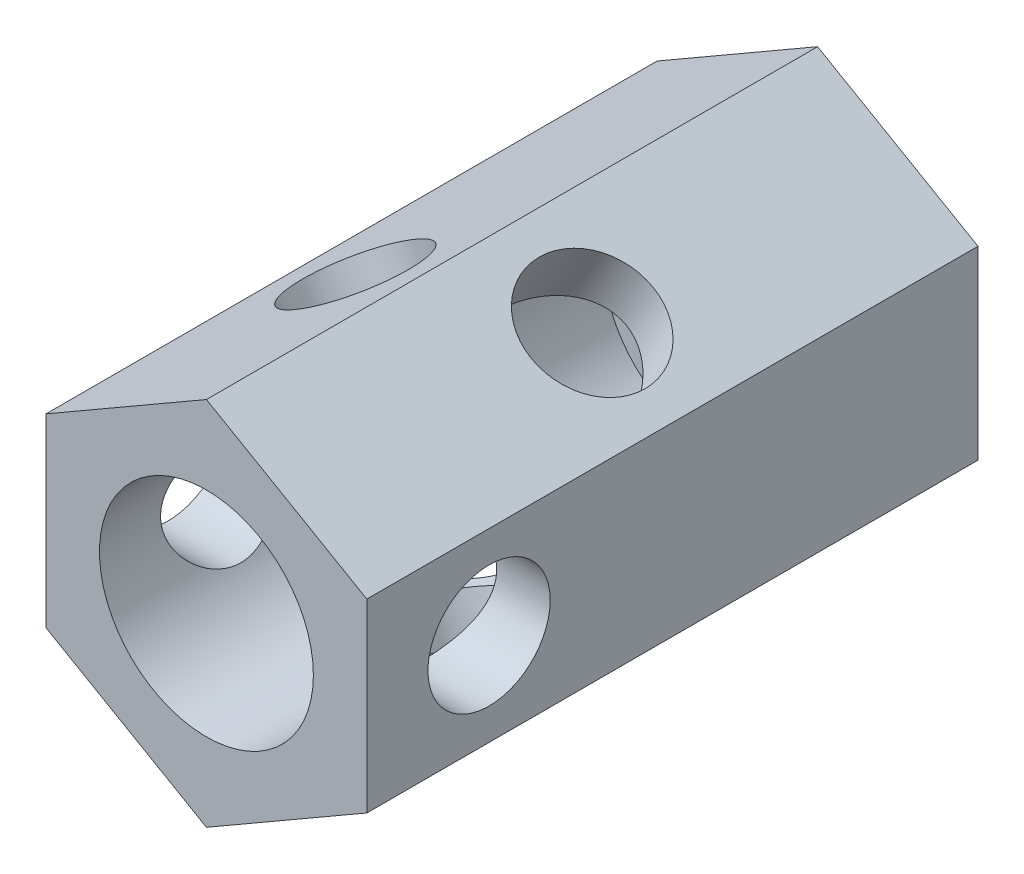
ISO-10303-21;
HEADER;
FILE_DESCRIPTION(('STEP AP214'),'2;1');
FILE_NAME('part.step','',(''),(''),'','','');
FILE_SCHEMA(('AUTOMOTIVE_DESIGN { 1 0 10303 214 1 1 1 1 }'));
ENDSEC;
DATA;
#1=APPLICATION_CONTEXT('core data for automotive mechanical design processes');
#2=APPLICATION_PROTOCOL_DEFINITION('international standard','automotive_design',2000,#1);
#3=PRODUCT_CONTEXT('',#1,'mechanical');
#4=PRODUCT('Part','Part','',(#3));
#5=PRODUCT_RELATED_PRODUCT_CATEGORY('part','',(#4));
#6=PRODUCT_DEFINITION_FORMATION('','',#4);
#7=PRODUCT_DEFINITION_CONTEXT('part definition',#1,'design');
#8=PRODUCT_DEFINITION('design','',#6,#7);
#9=PRODUCT_DEFINITION_SHAPE('','',#8);
#10=(LENGTH_UNIT() NAMED_UNIT(*) SI_UNIT(.MILLI.,.METRE.));
#11=(NAMED_UNIT(*) PLANE_ANGLE_UNIT() SI_UNIT($,.RADIAN.));
#12=(NAMED_UNIT(*) SI_UNIT($,.STERADIAN.) SOLID_ANGLE_UNIT());
#13=UNCERTAINTY_MEASURE_WITH_UNIT(LENGTH_MEASURE(1.E-05),#10,'distance_accuracy_value','');
#14=(GEOMETRIC_REPRESENTATION_CONTEXT(3) GLOBAL_UNCERTAINTY_ASSIGNED_CONTEXT((#13)) GLOBAL_UNIT_ASSIGNED_CONTEXT((#10,
#11,#12)) REPRESENTATION_CONTEXT('',''));
#15=CARTESIAN_POINT('',(0.,0.,0.));
#16=DIRECTION('',(0.,0.,1.));
#17=DIRECTION('',(1.,0.,0.));
#18=AXIS2_PLACEMENT_3D('',#15,#16,#17);
#19=CARTESIAN_POINT('',(-21.0444173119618,1.05818132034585E-13,40.));
#20=DIRECTION('',(0.,0.,-1.));
#21=DIRECTION('',(-1.,0.,0.));
#22=AXIS2_PLACEMENT_3D('',#19,#20,#21);
#23=PLANE('',#22);
#24=CARTESIAN_POINT('',(0.,0.,40.));
#25=DIRECTION('',(0.,0.,1.));
#26=DIRECTION('',(1.,0.,0.));
#27=AXIS2_PLACEMENT_3D('',#24,#25,#26);
#28=CIRCLE('',#27,7.);
#29=CARTESIAN_POINT('',(7.,0.,40.));
#30=VERTEX_POINT('',#29);
#31=EDGE_CURVE('E140',#30,#30,#28,.T.);
#32=ORIENTED_EDGE('',*,*,#31,.F.);
#33=EDGE_LOOP('',(#32));
#34=FACE_BOUND('',#33,.T.);
#35=DIRECTION('',(0.866025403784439,0.5,0.));
#36=VECTOR('',#35,1.);
#37=CARTESIAN_POINT('',(0.,-12.1243556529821,40.));
#38=LINE('',#37,#36);
#39=CARTESIAN_POINT('',(0.,-12.1243556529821,40.));
#40=VERTEX_POINT('',#39);
#41=CARTESIAN_POINT('',(10.5,-6.06217782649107,40.));
#42=VERTEX_POINT('',#41);
#43=EDGE_CURVE('E90',#40,#42,#38,.T.);
#44=ORIENTED_EDGE('',*,*,#43,.T.);
#45=DIRECTION('',(0.,-1.,0.));
#46=VECTOR('',#45,1.);
#47=CARTESIAN_POINT('',(10.5,6.08782217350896,40.));
#48=LINE('',#47,#46);
#49=CARTESIAN_POINT('',(10.5,6.06217782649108,40.));
#50=VERTEX_POINT('',#49);
#51=EDGE_CURVE('E9',#50,#42,#48,.T.);
#52=ORIENTED_EDGE('',*,*,#51,.F.);
#53=DIRECTION('',(-0.866025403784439,0.5,0.));
#54=VECTOR('',#53,1.);
#55=CARTESIAN_POINT('',(10.5,6.06217782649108,40.));
#56=LINE('',#55,#54);
#57=CARTESIAN_POINT('',(0.,12.1243556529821,40.));
#58=VERTEX_POINT('',#57);
#59=EDGE_CURVE('E44',#50,#58,#56,.T.);
#60=ORIENTED_EDGE('',*,*,#59,.T.);
#61=DIRECTION('',(-0.866025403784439,-0.5,0.));
#62=VECTOR('',#61,1.);
#63=CARTESIAN_POINT('',(0.,12.1243556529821,40.));
#64=LINE('',#63,#62);
#65=CARTESIAN_POINT('',(-10.5,6.06217782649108,40.));
#66=VERTEX_POINT('',#65);
#67=EDGE_CURVE('E80',#58,#66,#64,.T.);
#68=ORIENTED_EDGE('',*,*,#67,.T.);
#69=DIRECTION('',(0.,-1.,0.));
#70=VECTOR('',#69,1.);
#71=CARTESIAN_POINT('',(-10.5,6.08782217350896,40.));
#72=LINE('',#71,#70);
#73=CARTESIAN_POINT('',(-10.5,-6.06217782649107,40.));
#74=VERTEX_POINT('',#73);
#75=EDGE_CURVE('E28',#66,#74,#72,.T.);
#76=ORIENTED_EDGE('',*,*,#75,.T.);
#77=DIRECTION('',(0.866025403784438,-0.5,0.));
#78=VECTOR('',#77,1.);
#79=CARTESIAN_POINT('',(-10.5,-6.06217782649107,40.));
#80=LINE('',#79,#78);
#81=EDGE_CURVE('E105',#74,#40,#80,.T.);
#82=ORIENTED_EDGE('',*,*,#81,.T.);
#83=EDGE_LOOP('',(#44,#52,#60,#68,#76,#82));
#84=FACE_BOUND('',#83,.T.);
#85=ADVANCED_FACE('F14',(#34,#84),#23,.F.);
#86=CARTESIAN_POINT('',(9.73889567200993,16.8682621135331,20.));
#87=DIRECTION('',(-0.500000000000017,-0.866025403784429,0.));
#88=DIRECTION('',(0.866025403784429,-0.500000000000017,0.));
#89=AXIS2_PLACEMENT_3D('',#86,#87,#88);
#90=CYLINDRICAL_SURFACE('',#89,4.);
#91=CARTESIAN_POINT('',(6.33638293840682,2.97493718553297,20.));
#92=CARTESIAN_POINT('',(6.33638302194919,2.97493697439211,20.1017675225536));
#93=CARTESIAN_POINT('',(6.33437158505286,2.97923256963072,20.203537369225));
#94=CARTESIAN_POINT('',(6.32632572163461,2.99627943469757,20.4062056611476));
#95=CARTESIAN_POINT('',(6.32029101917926,3.00903128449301,20.5071040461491));
#96=CARTESIAN_POINT('',(6.3041875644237,3.04262472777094,20.7072873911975));
#97=CARTESIAN_POINT('',(6.29411602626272,3.06347190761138,20.8065711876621));
#98=CARTESIAN_POINT('',(6.26992765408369,3.11267627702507,21.0027709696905));
#99=CARTESIAN_POINT('',(6.255809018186,3.14103681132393,21.0996858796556));
#100=CARTESIAN_POINT('',(6.20756391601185,3.23592126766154,21.3846294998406));
#101=CARTESIAN_POINT('',(6.1674267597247,3.3125228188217,21.5683917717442));
#102=CARTESIAN_POINT('',(6.07070145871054,3.48661077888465,21.920867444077));
#103=CARTESIAN_POINT('',(6.01410803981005,3.58410388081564,22.0895759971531));
#104=CARTESIAN_POINT('',(5.8765967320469,3.8058436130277,22.4276228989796));
#105=CARTESIAN_POINT('',(5.79369055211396,3.9318522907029,22.5949971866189));
#106=CARTESIAN_POINT('',(5.60547650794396,4.19581590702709,22.9064187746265));
#107=CARTESIAN_POINT('',(5.50015416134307,4.33377853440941,23.0504508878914));
#108=CARTESIAN_POINT('',(5.31929872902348,4.55138854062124,23.252787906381));
#109=CARTESIAN_POINT('',(5.251812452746,4.62921440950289,23.3204194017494));
#110=CARTESIAN_POINT('',(5.10986645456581,4.78543429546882,23.4471459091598));
#111=CARTESIAN_POINT('',(5.03540961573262,4.86382806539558,23.5062444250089));
#112=CARTESIAN_POINT('',(4.87962899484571,5.02009875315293,23.615277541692));
#113=CARTESIAN_POINT('',(4.79830787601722,5.09797585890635,23.6652156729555));
#114=CARTESIAN_POINT('',(4.62903043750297,5.25215903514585,23.7553235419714));
#115=CARTESIAN_POINT('',(4.541075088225,5.32846533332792,23.7954947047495));
#116=CARTESIAN_POINT('',(4.36703898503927,5.47179445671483,23.8623834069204));
#117=CARTESIAN_POINT('',(4.28147910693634,5.53904186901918,23.8899759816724));
#118=CARTESIAN_POINT('',(4.1057474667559,5.67052682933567,23.9361656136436));
#119=CARTESIAN_POINT('',(4.01557632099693,5.73476477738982,23.954763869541));
#120=CARTESIAN_POINT('',(3.83134643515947,5.8594494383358,23.9826754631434));
#121=CARTESIAN_POINT('',(3.73729027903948,5.9198986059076,23.9919948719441));
#122=CARTESIAN_POINT('',(3.54604889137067,6.0363955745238,24.0012203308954));
#123=CARTESIAN_POINT('',(3.4488639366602,6.09244376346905,24.0011272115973));
#124=CARTESIAN_POINT('',(3.26339941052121,6.19355156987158,23.9920734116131));
#125=CARTESIAN_POINT('',(3.17535606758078,6.23913701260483,23.9841170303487));
#126=CARTESIAN_POINT('',(2.99818993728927,6.32618549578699,23.9609131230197));
#127=CARTESIAN_POINT('',(2.90906682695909,6.36764726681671,23.9456633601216));
#128=CARTESIAN_POINT('',(2.64116803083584,6.48553311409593,23.8892215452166));
#129=CARTESIAN_POINT('',(2.46168931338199,6.55555171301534,23.8373280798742));
#130=CARTESIAN_POINT('',(2.10497901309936,6.67870479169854,23.7066949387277));
#131=CARTESIAN_POINT('',(1.92778154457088,6.73168379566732,23.6277209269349));
#132=CARTESIAN_POINT('',(1.58181305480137,6.82127697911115,23.4457658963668));
#133=CARTESIAN_POINT('',(1.41304453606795,6.85788632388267,23.3427777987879));
#134=CARTESIAN_POINT('',(1.0695563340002,6.9202500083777,23.1025045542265));
#135=CARTESIAN_POINT('',(0.896320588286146,6.94430942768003,22.9626584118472));
#136=CARTESIAN_POINT('',(0.570147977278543,6.97867409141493,22.6593439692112));
#137=CARTESIAN_POINT('',(0.417236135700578,6.9889625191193,22.4958470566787));
#138=CARTESIAN_POINT('',(0.12304987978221,7.0006151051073,22.130185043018));
#139=CARTESIAN_POINT('',(-0.0155469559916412,7.00098793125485,21.9257902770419));
#140=CARTESIAN_POINT('',(-0.193742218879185,6.99757211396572,21.6032492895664));
#141=CARTESIAN_POINT('',(-0.248182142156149,6.99577181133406,21.4931028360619));
#142=CARTESIAN_POINT('',(-0.346136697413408,6.99160768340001,21.2680844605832));
#143=CARTESIAN_POINT('',(-0.389655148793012,6.98924405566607,21.1532142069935));
#144=CARTESIAN_POINT('',(-0.484973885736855,6.98342534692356,20.8562669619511));
#145=CARTESIAN_POINT('',(-0.528525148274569,6.98007129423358,20.6714403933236));
#146=CARTESIAN_POINT('',(-0.583762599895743,6.97567361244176,20.2972006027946));
#147=CARTESIAN_POINT('',(-0.595479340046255,6.9746277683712,20.1077919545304));
#148=CARTESIAN_POINT('',(-0.586156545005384,6.97541655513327,19.7296793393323));
#149=CARTESIAN_POINT('',(-0.565097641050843,6.97725288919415,19.5409758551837));
#150=CARTESIAN_POINT('',(-0.491913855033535,6.98278746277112,19.1696990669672));
#151=CARTESIAN_POINT('',(-0.439766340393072,6.98648705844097,18.9871303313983));
#152=CARTESIAN_POINT('',(-0.307186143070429,6.99357236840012,18.6300941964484));
#153=CARTESIAN_POINT('',(-0.226407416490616,6.99695357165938,18.4557568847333));
#154=CARTESIAN_POINT('',(-0.0409523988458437,7.00049329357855,18.1203148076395));
#155=CARTESIAN_POINT('',(0.0637336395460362,7.00065049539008,17.9592154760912));
#156=CARTESIAN_POINT('',(0.312141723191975,6.99431566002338,17.6265104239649));
#157=CARTESIAN_POINT('',(0.459460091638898,6.98671382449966,17.4576107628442));
#158=CARTESIAN_POINT('',(0.776008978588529,6.95866591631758,17.1426083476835));
#159=CARTESIAN_POINT('',(0.945257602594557,6.93820917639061,16.9965246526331));
#160=CARTESIAN_POINT('',(1.22044968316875,6.89349997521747,16.7902094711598));
#161=CARTESIAN_POINT('',(1.32066090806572,6.87508477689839,16.7208991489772));
#162=CARTESIAN_POINT('',(1.52524770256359,6.83260664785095,16.5906946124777));
#163=CARTESIAN_POINT('',(1.62962146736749,6.80854614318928,16.5297968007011));
#164=CARTESIAN_POINT('',(1.84159076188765,6.75429595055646,16.417020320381));
#165=CARTESIAN_POINT('',(1.94918595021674,6.72410691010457,16.3651407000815));
#166=CARTESIAN_POINT('',(2.16650935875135,6.65726268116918,16.2710493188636));
#167=CARTESIAN_POINT('',(2.27623620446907,6.62061154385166,16.228831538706));
#168=CARTESIAN_POINT('',(2.48779657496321,6.54388925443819,16.1576399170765));
#169=CARTESIAN_POINT('',(2.58955005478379,6.50433510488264,16.1278706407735));
#170=CARTESIAN_POINT('',(2.79292426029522,6.4196337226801,16.0774035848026));
#171=CARTESIAN_POINT('',(2.89454502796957,6.37448951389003,16.0567009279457));
#172=CARTESIAN_POINT('',(3.09665342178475,6.27879231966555,16.0246689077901));
#173=CARTESIAN_POINT('',(3.19714158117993,6.22824200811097,16.0133349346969));
#174=CARTESIAN_POINT('',(3.39603280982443,6.12206371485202,16.0002078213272));
#175=CARTESIAN_POINT('',(3.49443608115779,6.06643622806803,15.998413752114));
#176=CARTESIAN_POINT('',(3.67689252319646,5.95738254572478,16.0040420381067));
#177=CARTESIAN_POINT('',(3.76127996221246,5.90445735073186,16.010413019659));
#178=CARTESIAN_POINT('',(3.92713452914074,5.79546925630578,16.0305360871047));
#179=CARTESIAN_POINT('',(4.00860073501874,5.73940538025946,16.0442904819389));
#180=CARTESIAN_POINT('',(4.16804835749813,5.62467881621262,16.0790099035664));
#181=CARTESIAN_POINT('',(4.24603101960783,5.56601707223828,16.0999723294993));
#182=CARTESIAN_POINT('',(4.39814645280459,5.44662093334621,16.1488627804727));
#183=CARTESIAN_POINT('',(4.47227772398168,5.38588574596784,16.1767934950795));
#184=CARTESIAN_POINT('',(4.68855341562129,5.20127901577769,16.2706982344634));
#185=CARTESIAN_POINT('',(4.82448294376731,5.07507665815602,16.3467633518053));
#186=CARTESIAN_POINT('',(5.07804664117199,4.82138270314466,16.52298927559));
#187=CARTESIAN_POINT('',(5.19567578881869,4.6938907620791,16.6231566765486));
#188=CARTESIAN_POINT('',(5.42447891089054,4.42820541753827,16.8572275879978));
#189=CARTESIAN_POINT('',(5.53352317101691,4.29037553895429,16.9936287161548));
#190=CARTESIAN_POINT('',(5.72973039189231,4.02461810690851,17.2900612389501));
#191=CARTESIAN_POINT('',(5.81686691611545,3.8967026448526,17.4501208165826));
#192=CARTESIAN_POINT('',(5.97827581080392,3.64483719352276,17.8092287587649));
#193=CARTESIAN_POINT('',(6.05024882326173,3.52270192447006,18.0106041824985));
#194=CARTESIAN_POINT('',(6.16987140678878,3.30874457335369,18.4353723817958));
#195=CARTESIAN_POINT('',(6.21756083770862,3.21687290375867,18.6587283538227));
#196=CARTESIAN_POINT('',(6.2811828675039,3.09040186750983,19.0685810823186));
#197=CARTESIAN_POINT('',(6.30189654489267,3.04749022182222,19.2517414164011));
#198=CARTESIAN_POINT('',(6.32259493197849,3.00416601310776,19.5303505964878));
#199=CARTESIAN_POINT('',(6.32776570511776,2.9932317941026,19.6238711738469));
#200=CARTESIAN_POINT('',(6.33465915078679,2.97861856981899,19.8115939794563));
#201=CARTESIAN_POINT('',(6.33638286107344,2.97493738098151,19.9057959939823));
#202=CARTESIAN_POINT('',(6.33638293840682,2.97493718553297,20.));
#203=B_SPLINE_CURVE_WITH_KNOTS('',3,(#91,#92,#93,#94,#95,#96,#97,#98,#99,#100,#101,#102,#103,
#104,#105,#106,#107,#108,#109,#110,#111,#112,#113,#114,#115,#116,#117,#118,#119,#120,#121,#122,
#123,#124,#125,#126,#127,#128,#129,#130,#131,#132,#133,#134,#135,#136,#137,#138,#139,#140,#141,
#142,#143,#144,#145,#146,#147,#148,#149,#150,#151,#152,#153,#154,#155,#156,#157,#158,#159,#160,
#161,#162,#163,#164,#165,#166,#167,#168,#169,#170,#171,#172,#173,#174,#175,#176,#177,#178,#179,
#180,#181,#182,#183,#184,#185,#186,#187,#188,#189,#190,#191,#192,#193,#194,#195,#196,#197,#198,
#199,#200,#201,#202),.UNSPECIFIED.,.T.,.F.,(4,2,2,2,2,2,2,2,2,2,2,2,2,2,2,2,2,2,2,2,2,2,2,2,2,2,
2,2,2,2,2,2,2,2,2,2,2,2,2,2,2,2,2,2,2,2,2,2,2,2,2,2,2,2,2,4),(0.,0.305197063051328,
0.610415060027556,0.915844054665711,1.22140924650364,1.8279079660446,2.43460128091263,
3.10789711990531,3.78162928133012,4.15089858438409,4.52001582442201,4.88899050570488,
5.25791132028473,5.59423956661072,5.93052297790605,6.26658621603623,6.60261980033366,
6.90064091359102,7.19875348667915,7.7943934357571,8.39532344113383,8.99643081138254,
9.66548971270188,10.3353649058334,11.0719848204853,11.4401367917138,11.8081598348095,
12.3752119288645,12.9417196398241,13.508562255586,14.0758180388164,14.6501777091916,
15.2247719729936,15.8948940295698,16.5655729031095,16.9348482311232,17.3039651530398,
17.6730430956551,18.0418904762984,18.380880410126,18.7196877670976,19.0583283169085,
19.3969358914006,19.6960183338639,19.9951943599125,20.294262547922,20.5934463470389,
21.192174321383,21.7910662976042,22.4557684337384,23.1212688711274,23.8563890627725,
24.590298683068,25.1554256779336,25.4380251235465,25.7205394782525),.UNSPECIFIED.);
#204=CARTESIAN_POINT('',(6.33638293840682,2.97493718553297,20.));
#205=VERTEX_POINT('',#204);
#206=EDGE_CURVE('E151',#205,#205,#203,.T.);
#207=ORIENTED_EDGE('',*,*,#206,.T.);
#208=EDGE_LOOP('',(#207));
#209=FACE_BOUND('',#208,.T.);
#210=CARTESIAN_POINT('',(5.25000000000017,9.09326673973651,20.));
#211=DIRECTION('',(0.5,0.866025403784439,0.));
#212=DIRECTION('',(-0.866025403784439,0.5,0.));
#213=AXIS2_PLACEMENT_3D('',#210,#211,#212);
#214=CIRCLE('',#213,4.);
#215=CARTESIAN_POINT('',(1.78589838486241,11.0932667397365,20.));
#216=VERTEX_POINT('',#215);
#217=EDGE_CURVE('E122',#216,#216,#214,.T.);
#218=ORIENTED_EDGE('',*,*,#217,.T.);
#219=EDGE_LOOP('',(#218));
#220=FACE_BOUND('',#219,.T.);
#221=ADVANCED_FACE('F156',(#209,#220),#90,.F.);
#222=CARTESIAN_POINT('',(0.591820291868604,-6.9749371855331,20.));
#223=CARTESIAN_POINT('',(0.591820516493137,-6.97493715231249,19.8982324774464));
#224=CARTESIAN_POINT('',(0.58709470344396,-6.97534299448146,19.796462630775));
#225=CARTESIAN_POINT('',(0.568308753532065,-6.9768985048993,19.5937943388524));
#226=CARTESIAN_POINT('',(0.554247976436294,-6.97804822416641,19.4928959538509));
#227=CARTESIAN_POINT('',(0.517103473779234,-6.98089894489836,19.2927126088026));
#228=CARTESIAN_POINT('',(0.494013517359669,-6.98260032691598,19.1934288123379));
#229=CARTESIAN_POINT('',(0.439307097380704,-6.9862547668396,18.9972290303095));
#230=CARTESIAN_POINT('',(0.407686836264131,-6.98820793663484,18.9003141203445));
#231=CARTESIAN_POINT('',(0.301391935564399,-6.99386868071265,18.6153705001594));
#232=CARTESIAN_POINT('',(0.21498446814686,-6.99740965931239,18.4316082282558));
#233=CARTESIAN_POINT('',(0.0158572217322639,-7.00068707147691,18.0791325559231));
#234=CARTESIAN_POINT('',(-0.096870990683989,-7.00042228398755,17.910424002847));
#235=CARTESIAN_POINT('',(-0.357658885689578,-6.99220386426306,17.5723771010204));
#236=CARTESIAN_POINT('',(-0.508238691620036,-6.98340934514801,17.4050028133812));
#237=CARTESIAN_POINT('',(-0.830944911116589,-6.95239300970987,17.0935812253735));
#238=CARTESIAN_POINT('',(-1.00308522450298,-6.93016249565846,16.9495491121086));
#239=CARTESIAN_POINT('',(-1.2819687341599,-6.88234209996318,16.747212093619));
#240=CARTESIAN_POINT('',(-1.38311105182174,-6.86281020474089,16.6795805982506));
#241=CARTESIAN_POINT('',(-1.58937444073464,-6.81799130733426,16.5528540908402));
#242=CARTESIAN_POINT('',(-1.69449385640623,-6.79270667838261,16.4937555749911));
#243=CARTESIAN_POINT('',(-1.90771855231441,-6.73593204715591,16.384722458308));
#244=CARTESIAN_POINT('',(-2.01582266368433,-6.70444444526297,16.3347843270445));
#245=CARTESIAN_POINT('',(-2.23398793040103,-6.63493747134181,16.2446764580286));
#246=CARTESIAN_POINT('',(-2.34404879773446,-6.59691905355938,16.2045052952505));
#247=CARTESIAN_POINT('',(-2.55519351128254,-6.51786392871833,16.1376165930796));
#248=CARTESIAN_POINT('',(-2.65621141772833,-6.47739060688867,16.1100240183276));
#249=CARTESIAN_POINT('',(-2.85794655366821,-6.39094502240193,16.0638343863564));
#250=CARTESIAN_POINT('',(-2.95866382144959,-6.34497349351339,16.045236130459));
#251=CARTESIAN_POINT('',(-3.15875884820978,-6.24776806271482,16.0173245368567));
#252=CARTESIAN_POINT('',(-3.25813744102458,-6.19653762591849,16.0080051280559));
#253=CARTESIAN_POINT('',(-3.45464746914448,-6.08916621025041,15.9987796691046));
#254=CARTESIAN_POINT('',(-3.5517791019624,-6.03302566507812,15.9988727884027));
#255=CARTESIAN_POINT('',(-3.73207329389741,-5.92296257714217,16.0079265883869));
#256=CARTESIAN_POINT('',(-3.81557311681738,-5.86950752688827,16.0158829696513));
#257=CARTESIAN_POINT('',(-3.97954237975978,-5.75960139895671,16.0390868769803));
#258=CARTESIAN_POINT('',(-4.0600108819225,-5.70314940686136,16.0543366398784));
#259=CARTESIAN_POINT('',(-4.29605241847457,-5.53008516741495,16.1107784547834));
#260=CARTESIAN_POINT('',(-4.44642966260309,-5.40966133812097,16.1626719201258));
#261=CARTESIAN_POINT('',(-4.73143850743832,-5.16231769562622,16.2933050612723));
#262=CARTESIAN_POINT('',(-4.86591840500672,-5.03534968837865,16.3722790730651));
#263=CARTESIAN_POINT('',(-5.11649262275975,-4.78052877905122,16.5542341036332));
#264=CARTESIAN_POINT('',(-5.23258150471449,-4.65267562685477,16.6572222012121));
#265=CARTESIAN_POINT('',(-5.45833414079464,-4.38638796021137,16.8974954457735));
#266=CARTESIAN_POINT('',(-5.56578808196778,-4.2483911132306,17.0373415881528));
#267=CARTESIAN_POINT('',(-5.7586350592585,-3.98309967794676,17.3406560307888));
#268=CARTESIAN_POINT('',(-5.84400101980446,-3.85581835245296,17.5041529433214));
#269=CARTESIAN_POINT('',(-6.00118558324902,-3.60687187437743,17.8698149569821));
#270=CARTESIAN_POINT('',(-6.07080687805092,-3.4870299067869,18.0742097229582));
#271=CARTESIAN_POINT('',(-6.15694632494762,-3.33100037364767,18.3967507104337));
#272=CARTESIAN_POINT('',(-6.18260717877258,-3.28295386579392,18.5068971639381));
#273=CARTESIAN_POINT('',(-6.22797821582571,-3.1960406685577,18.7319155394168));
#274=CARTESIAN_POINT('',(-6.24769047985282,-3.15717077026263,18.8467857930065));
#275=CARTESIAN_POINT('',(-6.29031069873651,-3.07171296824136,19.1437330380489));
#276=CARTESIAN_POINT('',(-6.30918163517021,-3.03231944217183,19.3285596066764));
#277=CARTESIAN_POINT('',(-6.33299185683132,-2.98228356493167,19.7027993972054));
#278=CARTESIAN_POINT('',(-6.33794449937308,-2.9716136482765,19.8922080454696));
#279=CARTESIAN_POINT('',(-6.33396621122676,-2.9800818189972,20.2703206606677));
#280=CARTESIAN_POINT('',(-6.32502707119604,-2.99923753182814,20.4590241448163));
#281=CARTESIAN_POINT('',(-6.29322825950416,-3.06538383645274,20.8303009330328));
#282=CARTESIAN_POINT('',(-6.27035844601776,-3.11239470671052,21.0128696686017));
#283=CARTESIAN_POINT('',(-6.21020440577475,-3.23075518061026,21.3699058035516));
#284=CARTESIAN_POINT('',(-6.17274325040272,-3.30240221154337,21.5442431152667));
#285=CARTESIAN_POINT('',(-6.08308123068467,-3.46478082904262,21.8796851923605));
#286=CARTESIAN_POINT('',(-6.03087435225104,-3.5555201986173,22.0407845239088));
#287=CARTESIAN_POINT('',(-5.90118418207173,-3.76748049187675,22.3734895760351));
#288=CARTESIAN_POINT('',(-5.82094161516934,-3.89126102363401,22.5423892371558));
#289=CARTESIAN_POINT('',(-5.63837697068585,-4.15137644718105,22.8573916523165));
#290=CARTESIAN_POINT('',(-5.53603660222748,-4.28772168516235,23.0034753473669));
#291=CARTESIAN_POINT('',(-5.35972125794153,-4.50369041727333,23.2097905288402));
#292=CARTESIAN_POINT('',(-5.293667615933,-4.58126828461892,23.2791008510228));
#293=CARTESIAN_POINT('',(-5.15458707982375,-4.73720658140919,23.4093053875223));
#294=CARTESIAN_POINT('',(-5.08156318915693,-4.81556666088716,23.4702031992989));
#295=CARTESIAN_POINT('',(-4.92859649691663,-4.97201235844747,23.582979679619));
#296=CARTESIAN_POINT('',(-4.84865442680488,-5.0500980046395,23.6348592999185));
#297=CARTESIAN_POINT('',(-4.68210392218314,-5.2048834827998,23.7289506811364));
#298=CARTESIAN_POINT('',(-4.59549968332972,-5.28158415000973,23.771168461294));
#299=CARTESIAN_POINT('',(-4.42327604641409,-5.42643966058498,23.8423600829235));
#300=CARTESIAN_POINT('',(-4.3381444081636,-5.4947836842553,23.8721293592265));
#301=CARTESIAN_POINT('',(-4.16310375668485,-5.62856022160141,23.9225964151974));
#302=CARTESIAN_POINT('',(-4.07319734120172,-5.69399428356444,23.9432990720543));
#303=CARTESIAN_POINT('',(-3.88926694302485,-5.82117668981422,23.9753310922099));
#304=CARTESIAN_POINT('',(-3.79524500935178,-5.8829268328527,23.9866650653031));
#305=CARTESIAN_POINT('',(-3.6038462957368,-6.00208254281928,23.9997921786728));
#306=CARTESIAN_POINT('',(-3.50646984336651,-6.05948853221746,24.001586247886));
#307=CARTESIAN_POINT('',(-3.32079836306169,-6.16297360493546,23.9959579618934));
#308=CARTESIAN_POINT('',(-3.23277008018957,-6.20959267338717,23.989586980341));
#309=CARTESIAN_POINT('',(-3.05545633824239,-6.29873289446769,23.9694639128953));
#310=CARTESIAN_POINT('',(-2.96617049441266,-6.34125276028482,23.9557095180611));
#311=CARTESIAN_POINT('',(-2.78709056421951,-6.42197516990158,23.9209900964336));
#312=CARTESIAN_POINT('',(-2.69729667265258,-6.46017926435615,23.9000276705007));
#313=CARTESIAN_POINT('',(-2.51783886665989,-6.5322170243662,23.8511372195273));
#314=CARTESIAN_POINT('',(-2.42817501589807,-6.56604899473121,23.8232065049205));
#315=CARTESIAN_POINT('',(-2.16016305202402,-6.6610458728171,23.7293017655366));
#316=CARTESIAN_POINT('',(-1.98290384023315,-6.71566311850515,23.6532366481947));
#317=CARTESIAN_POINT('',(-1.63641658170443,-6.80840874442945,23.47701072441));
#318=CARTESIAN_POINT('',(-1.46719074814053,-6.84653260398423,23.3768433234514));
#319=CARTESIAN_POINT('',(-1.12269892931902,-6.91183924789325,23.1427724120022));
#320=CARTESIAN_POINT('',(-0.948812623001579,-6.93735940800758,23.0063712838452));
#321=CARTESIAN_POINT('',(-0.620556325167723,-6.97440112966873,22.7099387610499));
#322=CARTESIAN_POINT('',(-0.46621002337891,-6.9859058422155,22.5498791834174));
#323=CARTESIAN_POINT('',(-0.167383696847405,-6.99975731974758,22.1907712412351));
#324=CARTESIAN_POINT('',(-0.0256249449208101,-7.0010201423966,21.9893958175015));
#325=CARTESIAN_POINT('',(0.21947884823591,-6.99763766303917,21.5646276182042));
#326=CARTESIAN_POINT('',(0.322886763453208,-6.99300208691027,21.3412716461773));
#327=CARTESIAN_POINT('',(0.464224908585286,-6.9848648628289,20.9314189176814));
#328=CARTESIAN_POINT('',(0.511744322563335,-6.98134761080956,20.7482585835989));
#329=CARTESIAN_POINT('',(0.559613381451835,-6.97761083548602,20.4696494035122));
#330=CARTESIAN_POINT('',(0.571668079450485,-6.97662174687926,20.3761288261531));
#331=CARTESIAN_POINT('',(0.587770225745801,-6.97528503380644,20.1884060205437));
#332=CARTESIAN_POINT('',(0.591820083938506,-6.97493721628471,20.0942040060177));
#333=CARTESIAN_POINT('',(0.591820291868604,-6.9749371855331,20.));
#334=B_SPLINE_CURVE_WITH_KNOTS('',3,(#222,#223,#224,#225,#226,#227,#228,#229,#230,#231,#232,
#233,#234,#235,#236,#237,#238,#239,#240,#241,#242,#243,#244,#245,#246,#247,#248,#249,#250,#251,
#252,#253,#254,#255,#256,#257,#258,#259,#260,#261,#262,#263,#264,#265,#266,#267,#268,#269,#270,
#271,#272,#273,#274,#275,#276,#277,#278,#279,#280,#281,#282,#283,#284,#285,#286,#287,#288,#289,
#290,#291,#292,#293,#294,#295,#296,#297,#298,#299,#300,#301,#302,#303,#304,#305,#306,#307,#308,
#309,#310,#311,#312,#313,#314,#315,#316,#317,#318,#319,#320,#321,#322,#323,#324,#325,#326,#327,
#328,#329,#330,#331,#332,#333),.UNSPECIFIED.,.T.,.F.,(4,2,2,2,2,2,2,2,2,2,2,2,2,2,2,2,2,2,2,2,2,
2,2,2,2,2,2,2,2,2,2,2,2,2,2,2,2,2,2,2,2,2,2,2,2,2,2,2,2,2,2,2,2,2,2,4),(0.,0.305197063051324,
0.610415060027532,0.915844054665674,1.2214092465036,1.82790796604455,2.43460128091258,
3.10789711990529,3.7816292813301,4.15089858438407,4.52001582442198,4.88899050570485,
5.2579113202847,5.59423956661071,5.93052297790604,6.26658621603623,6.60261980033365,
6.90064091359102,7.19875348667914,7.7943934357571,8.39532344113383,8.99643081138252,
9.66548971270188,10.3353649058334,11.0719848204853,11.4401367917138,11.8081598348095,
12.3752119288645,12.9417196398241,13.508562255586,14.0758180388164,14.6501777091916,
15.2247719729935,15.8948940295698,16.5655729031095,16.9348482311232,17.3039651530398,
17.6730430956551,18.0418904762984,18.380880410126,18.7196877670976,19.0583283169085,
19.3969358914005,19.6960183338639,19.9951943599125,20.294262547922,20.5934463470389,
21.192174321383,21.7910662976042,22.4557684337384,23.1212688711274,23.8563890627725,
24.590298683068,25.1554256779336,25.4380251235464,25.7205394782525),.UNSPECIFIED.);
#335=CARTESIAN_POINT('',(0.591820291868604,-6.9749371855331,20.));
#336=VERTEX_POINT('',#335);
#337=EDGE_CURVE('E144',#336,#336,#334,.T.);
#338=ORIENTED_EDGE('',*,*,#337,.T.);
#339=EDGE_LOOP('',(#338));
#340=FACE_BOUND('',#339,.T.);
#341=CARTESIAN_POINT('',(-5.25000000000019,-9.09326673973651,20.));
#342=DIRECTION('',(-0.5,-0.866025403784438,0.));
#343=DIRECTION('',(0.866025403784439,-0.5,0.));
#344=AXIS2_PLACEMENT_3D('',#341,#342,#343);
#345=CIRCLE('',#344,4.);
#346=CARTESIAN_POINT('',(-1.78589838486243,-11.0932667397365,20.));
#347=VERTEX_POINT('',#346);
#348=EDGE_CURVE('E128',#347,#347,#345,.T.);
#349=ORIENTED_EDGE('',*,*,#348,.T.);
#350=EDGE_LOOP('',(#349));
#351=FACE_BOUND('',#350,.T.);
#352=ADVANCED_FACE('F198',(#340,#351),#90,.F.);
#353=CARTESIAN_POINT('',(-21.0444173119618,1.05818132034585E-13,0.));
#354=DIRECTION('',(0.,0.,-1.));
#355=DIRECTION('',(-1.,0.,0.));
#356=AXIS2_PLACEMENT_3D('',#353,#354,#355);
#357=PLANE('',#356);
#358=CARTESIAN_POINT('',(0.,0.,0.));
#359=DIRECTION('',(0.,0.,1.));
#360=DIRECTION('',(1.,0.,0.));
#361=AXIS2_PLACEMENT_3D('',#358,#359,#360);
#362=CIRCLE('',#361,4.5);
#363=CARTESIAN_POINT('',(4.5,0.,0.));
#364=VERTEX_POINT('',#363);
#365=EDGE_CURVE('E131',#364,#364,#362,.T.);
#366=ORIENTED_EDGE('',*,*,#365,.T.);
#367=EDGE_LOOP('',(#366));
#368=FACE_BOUND('',#367,.T.);
#369=DIRECTION('',(0.,-1.,0.));
#370=VECTOR('',#369,1.);
#371=CARTESIAN_POINT('',(10.5,6.08782217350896,0.));
#372=LINE('',#371,#370);
#373=CARTESIAN_POINT('',(10.5,6.06217782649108,0.));
#374=VERTEX_POINT('',#373);
#375=CARTESIAN_POINT('',(10.5,-6.06217782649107,0.));
#376=VERTEX_POINT('',#375);
#377=EDGE_CURVE('E215',#374,#376,#372,.T.);
#378=ORIENTED_EDGE('',*,*,#377,.T.);
#379=DIRECTION('',(0.866025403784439,0.5,0.));
#380=VECTOR('',#379,1.);
#381=CARTESIAN_POINT('',(0.,-12.1243556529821,0.));
#382=LINE('',#381,#380);
#383=CARTESIAN_POINT('',(0.,-12.1243556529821,0.));
#384=VERTEX_POINT('',#383);
#385=EDGE_CURVE('E36',#384,#376,#382,.T.);
#386=ORIENTED_EDGE('',*,*,#385,.F.);
#387=DIRECTION('',(0.866025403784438,-0.5,0.));
#388=VECTOR('',#387,1.);
#389=CARTESIAN_POINT('',(-10.5,-6.06217782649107,0.));
#390=LINE('',#389,#388);
#391=CARTESIAN_POINT('',(-10.5,-6.06217782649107,0.));
#392=VERTEX_POINT('',#391);
#393=EDGE_CURVE('E97',#392,#384,#390,.T.);
#394=ORIENTED_EDGE('',*,*,#393,.F.);
#395=DIRECTION('',(0.,-1.,0.));
#396=VECTOR('',#395,1.);
#397=CARTESIAN_POINT('',(-10.5,6.08782217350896,0.));
#398=LINE('',#397,#396);
#399=CARTESIAN_POINT('',(-10.5,6.06217782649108,0.));
#400=VERTEX_POINT('',#399);
#401=EDGE_CURVE('E96',#400,#392,#398,.T.);
#402=ORIENTED_EDGE('',*,*,#401,.F.);
#403=DIRECTION('',(-0.866025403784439,-0.5,0.));
#404=VECTOR('',#403,1.);
#405=CARTESIAN_POINT('',(0.,12.1243556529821,0.));
#406=LINE('',#405,#404);
#407=CARTESIAN_POINT('',(0.,12.1243556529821,0.));
#408=VERTEX_POINT('',#407);
#409=EDGE_CURVE('E77',#408,#400,#406,.T.);
#410=ORIENTED_EDGE('',*,*,#409,.F.);
#411=DIRECTION('',(-0.866025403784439,0.5,0.));
#412=VECTOR('',#411,1.);
#413=CARTESIAN_POINT('',(10.5,6.06217782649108,0.));
#414=LINE('',#413,#412);
#415=EDGE_CURVE('E84',#374,#408,#414,.T.);
#416=ORIENTED_EDGE('',*,*,#415,.F.);
#417=EDGE_LOOP('',(#378,#386,#394,#402,#410,#416));
#418=FACE_BOUND('',#417,.T.);
#419=ADVANCED_FACE('F93',(#368,#418),#357,.T.);
#420=CARTESIAN_POINT('',(9.73889567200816,-16.8682621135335,25.));
#421=DIRECTION('',(-0.49999999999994,0.866025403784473,0.));
#422=DIRECTION('',(-0.866025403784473,-0.49999999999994,0.));
#423=AXIS2_PLACEMENT_3D('',#420,#421,#422);
#424=CYLINDRICAL_SURFACE('',#423,4.);
#425=CARTESIAN_POINT('',(-0.591820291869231,-6.97493718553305,25.));
#426=CARTESIAN_POINT('',(-0.591820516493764,-6.97493715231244,25.1017675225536));
#427=CARTESIAN_POINT('',(-0.587094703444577,-6.97534299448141,25.2035373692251));
#428=CARTESIAN_POINT('',(-0.568308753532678,-6.97689850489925,25.4062056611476));
#429=CARTESIAN_POINT('',(-0.554247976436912,-6.97804822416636,25.5071040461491));
#430=CARTESIAN_POINT('',(-0.517103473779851,-6.98089894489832,25.7072873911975));
#431=CARTESIAN_POINT('',(-0.494013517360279,-6.98260032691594,25.8065711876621));
#432=CARTESIAN_POINT('',(-0.439307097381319,-6.98625476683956,26.0027709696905));
#433=CARTESIAN_POINT('',(-0.407686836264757,-6.9882079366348,26.0996858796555));
#434=CARTESIAN_POINT('',(-0.301391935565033,-6.99386868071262,26.3846294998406));
#435=CARTESIAN_POINT('',(-0.214984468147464,-6.99740965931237,26.5683917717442));
#436=CARTESIAN_POINT('',(-0.0158572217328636,-7.00068707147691,26.920867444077));
#437=CARTESIAN_POINT('',(0.0968709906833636,-7.00042228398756,27.0895759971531));
#438=CARTESIAN_POINT('',(0.357658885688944,-6.99220386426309,27.4276228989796));
#439=CARTESIAN_POINT('',(0.508238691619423,-6.98340934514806,27.5949971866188));
#440=CARTESIAN_POINT('',(0.830944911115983,-6.95239300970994,27.9064187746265));
#441=CARTESIAN_POINT('',(1.00308522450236,-6.93016249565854,28.0504508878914));
#442=CARTESIAN_POINT('',(1.28196873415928,-6.88234209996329,28.252787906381));
#443=CARTESIAN_POINT('',(1.38311105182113,-6.86281020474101,28.3204194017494));
#444=CARTESIAN_POINT('',(1.58937444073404,-6.8179913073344,28.4471459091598));
#445=CARTESIAN_POINT('',(1.69449385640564,-6.79270667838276,28.5062444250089));
#446=CARTESIAN_POINT('',(1.90771855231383,-6.73593204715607,28.615277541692));
#447=CARTESIAN_POINT('',(2.01582266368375,-6.70444444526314,28.6652156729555));
#448=CARTESIAN_POINT('',(2.23398793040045,-6.634937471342,28.7553235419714));
#449=CARTESIAN_POINT('',(2.34404879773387,-6.59691905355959,28.7954947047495));
#450=CARTESIAN_POINT('',(2.55519351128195,-6.51786392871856,28.8623834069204));
#451=CARTESIAN_POINT('',(2.65621141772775,-6.47739060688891,28.8899759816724));
#452=CARTESIAN_POINT('',(2.85794655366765,-6.39094502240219,28.9361656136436));
#453=CARTESIAN_POINT('',(2.95866382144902,-6.34497349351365,28.954763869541));
#454=CARTESIAN_POINT('',(3.15875884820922,-6.24776806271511,28.9826754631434));
#455=CARTESIAN_POINT('',(3.25813744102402,-6.19653762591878,28.9919948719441));
#456=CARTESIAN_POINT('',(3.45464746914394,-6.08916621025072,29.0012203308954));
#457=CARTESIAN_POINT('',(3.55177910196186,-6.03302566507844,29.0011272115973));
#458=CARTESIAN_POINT('',(3.73207329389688,-5.92296257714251,28.9920734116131));
#459=CARTESIAN_POINT('',(3.81557311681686,-5.86950752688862,28.9841170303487));
#460=CARTESIAN_POINT('',(3.97954237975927,-5.75960139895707,28.9609131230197));
#461=CARTESIAN_POINT('',(4.06001088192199,-5.70314940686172,28.9456633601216));
#462=CARTESIAN_POINT('',(4.29605241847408,-5.53008516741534,28.8892215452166));
#463=CARTESIAN_POINT('',(4.44642966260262,-5.40966133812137,28.8373280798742));
#464=CARTESIAN_POINT('',(4.73143850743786,-5.16231769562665,28.7066949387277));
#465=CARTESIAN_POINT('',(4.86591840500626,-5.03534968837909,28.6277209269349));
#466=CARTESIAN_POINT('',(5.11649262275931,-4.78052877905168,28.4457658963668));
#467=CARTESIAN_POINT('',(5.23258150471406,-4.65267562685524,28.3427777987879));
#468=CARTESIAN_POINT('',(5.45833414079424,-4.38638796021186,28.1025045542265));
#469=CARTESIAN_POINT('',(5.5657880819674,-4.24839111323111,27.9626584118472));
#470=CARTESIAN_POINT('',(5.75863505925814,-3.98309967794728,27.6593439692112));
#471=CARTESIAN_POINT('',(5.84400101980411,-3.85581835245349,27.4958470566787));
#472=CARTESIAN_POINT('',(6.0011855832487,-3.60687187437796,27.130185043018));
#473=CARTESIAN_POINT('',(6.07080687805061,-3.48702990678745,26.9257902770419));
#474=CARTESIAN_POINT('',(6.15694632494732,-3.33100037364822,26.6032492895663));
#475=CARTESIAN_POINT('',(6.18260717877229,-3.28295386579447,26.4931028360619));
#476=CARTESIAN_POINT('',(6.22797821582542,-3.19604066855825,26.2680844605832));
#477=CARTESIAN_POINT('',(6.24769047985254,-3.15717077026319,26.1532142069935));
#478=CARTESIAN_POINT('',(6.29031069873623,-3.07171296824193,25.8562669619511));
#479=CARTESIAN_POINT('',(6.30918163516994,-3.03231944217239,25.6714403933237));
#480=CARTESIAN_POINT('',(6.33299185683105,-2.98228356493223,25.2972006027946));
#481=CARTESIAN_POINT('',(6.33794449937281,-2.97161364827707,25.1077919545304));
#482=CARTESIAN_POINT('',(6.33396621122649,-2.98008181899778,24.7296793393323));
#483=CARTESIAN_POINT('',(6.32502707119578,-2.9992375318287,24.5409758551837));
#484=CARTESIAN_POINT('',(6.29322825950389,-3.0653838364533,24.1696990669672));
#485=CARTESIAN_POINT('',(6.27035844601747,-3.11239470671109,23.9871303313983));
#486=CARTESIAN_POINT('',(6.21020440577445,-3.23075518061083,23.6300941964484));
#487=CARTESIAN_POINT('',(6.17274325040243,-3.30240221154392,23.4557568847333));
#488=CARTESIAN_POINT('',(6.08308123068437,-3.46478082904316,23.1203148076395));
#489=CARTESIAN_POINT('',(6.03087435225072,-3.55552019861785,22.9592154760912));
#490=CARTESIAN_POINT('',(5.90118418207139,-3.76748049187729,22.6265104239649));
#491=CARTESIAN_POINT('',(5.82094161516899,-3.89126102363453,22.4576107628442));
#492=CARTESIAN_POINT('',(5.63837697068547,-4.15137644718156,22.1426083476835));
#493=CARTESIAN_POINT('',(5.53603660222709,-4.28772168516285,21.9965246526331));
#494=CARTESIAN_POINT('',(5.35972125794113,-4.50369041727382,21.7902094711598));
#495=CARTESIAN_POINT('',(5.29366761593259,-4.5812682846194,21.7208991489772));
#496=CARTESIAN_POINT('',(5.15458707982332,-4.73720658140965,21.5906946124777));
#497=CARTESIAN_POINT('',(5.08156318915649,-4.81556666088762,21.5297968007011));
#498=CARTESIAN_POINT('',(4.92859649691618,-4.97201235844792,21.417020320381));
#499=CARTESIAN_POINT('',(4.84865442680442,-5.05009800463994,21.3651407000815));
#500=CARTESIAN_POINT('',(4.68210392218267,-5.20488348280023,21.2710493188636));
#501=CARTESIAN_POINT('',(4.59549968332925,-5.28158415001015,21.228831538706));
#502=CARTESIAN_POINT('',(4.4232760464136,-5.42643966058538,21.1576399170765));
#503=CARTESIAN_POINT('',(4.33814440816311,-5.49478368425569,21.1278706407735));
#504=CARTESIAN_POINT('',(4.16310375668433,-5.62856022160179,21.0774035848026));
#505=CARTESIAN_POINT('',(4.0731973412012,-5.69399428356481,21.0567009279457));
#506=CARTESIAN_POINT('',(3.88926694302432,-5.82117668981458,21.0246689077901));
#507=CARTESIAN_POINT('',(3.79524500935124,-5.88292683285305,21.0133349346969));
#508=CARTESIAN_POINT('',(3.60384629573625,-6.00208254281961,21.0002078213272));
#509=CARTESIAN_POINT('',(3.50646984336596,-6.05948853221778,20.998413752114));
#510=CARTESIAN_POINT('',(3.32079836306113,-6.16297360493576,21.0040420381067));
#511=CARTESIAN_POINT('',(3.23277008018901,-6.20959267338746,21.010413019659));
#512=CARTESIAN_POINT('',(3.05545633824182,-6.29873289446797,21.0305360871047));
#513=CARTESIAN_POINT('',(2.96617049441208,-6.34125276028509,21.0442904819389));
#514=CARTESIAN_POINT('',(2.78709056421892,-6.42197516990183,21.0790099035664));
#515=CARTESIAN_POINT('',(2.697296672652,-6.4601792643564,21.0999723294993));
#516=CARTESIAN_POINT('',(2.5178388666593,-6.53221702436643,21.1488627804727));
#517=CARTESIAN_POINT('',(2.42817501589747,-6.56604899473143,21.1767934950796));
#518=CARTESIAN_POINT('',(2.16016305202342,-6.66104587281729,21.2706982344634));
#519=CARTESIAN_POINT('',(1.98290384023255,-6.71566311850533,21.3467633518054));
#520=CARTESIAN_POINT('',(1.63641658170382,-6.80840874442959,21.52298927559));
#521=CARTESIAN_POINT('',(1.4671907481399,-6.84653260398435,21.6231566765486));
#522=CARTESIAN_POINT('',(1.12269892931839,-6.91183924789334,21.8572275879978));
#523=CARTESIAN_POINT('',(0.948812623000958,-6.93735940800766,21.9936287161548));
#524=CARTESIAN_POINT('',(0.620556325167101,-6.97440112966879,22.2900612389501));
#525=CARTESIAN_POINT('',(0.466210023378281,-6.98590584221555,22.4501208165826));
#526=CARTESIAN_POINT('',(0.167383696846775,-6.9997573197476,22.8092287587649));
#527=CARTESIAN_POINT('',(0.0256249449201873,-7.0010201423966,23.0106041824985));
#528=CARTESIAN_POINT('',(-0.219478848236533,-6.99763766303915,23.4353723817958));
#529=CARTESIAN_POINT('',(-0.322886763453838,-6.99300208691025,23.6587283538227));
#530=CARTESIAN_POINT('',(-0.464224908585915,-6.98486486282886,24.0685810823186));
#531=CARTESIAN_POINT('',(-0.51174432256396,-6.98134761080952,24.2517414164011));
#532=CARTESIAN_POINT('',(-0.559613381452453,-6.97761083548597,24.5303505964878));
#533=CARTESIAN_POINT('',(-0.571668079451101,-6.97662174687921,24.6238711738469));
#534=CARTESIAN_POINT('',(-0.587770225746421,-6.97528503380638,24.8115939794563));
#535=CARTESIAN_POINT('',(-0.591820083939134,-6.97493721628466,24.9057959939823));
#536=CARTESIAN_POINT('',(-0.591820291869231,-6.97493718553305,25.));
#537=B_SPLINE_CURVE_WITH_KNOTS('',3,(#425,#426,#427,#428,#429,#430,#431,#432,#433,#434,#435,
#436,#437,#438,#439,#440,#441,#442,#443,#444,#445,#446,#447,#448,#449,#450,#451,#452,#453,#454,
#455,#456,#457,#458,#459,#460,#461,#462,#463,#464,#465,#466,#467,#468,#469,#470,#471,#472,#473,
#474,#475,#476,#477,#478,#479,#480,#481,#482,#483,#484,#485,#486,#487,#488,#489,#490,#491,#492,
#493,#494,#495,#496,#497,#498,#499,#500,#501,#502,#503,#504,#505,#506,#507,#508,#509,#510,#511,
#512,#513,#514,#515,#516,#517,#518,#519,#520,#521,#522,#523,#524,#525,#526,#527,#528,#529,#530,
#531,#532,#533,#534,#535,#536),.UNSPECIFIED.,.T.,.F.,(4,2,2,2,2,2,2,2,2,2,2,2,2,2,2,2,2,2,2,2,2,
2,2,2,2,2,2,2,2,2,2,2,2,2,2,2,2,2,2,2,2,2,2,2,2,2,2,2,2,2,2,2,2,2,2,4),(0.,0.305197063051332,
0.610415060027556,0.915844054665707,1.22140924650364,1.8279079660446,2.43460128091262,
3.10789711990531,3.78162928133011,4.15089858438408,4.520015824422,4.88899050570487,
5.25791132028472,5.59423956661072,5.93052297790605,6.26658621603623,6.60261980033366,
6.90064091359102,7.19875348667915,7.79439343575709,8.39532344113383,8.99643081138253,
9.66548971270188,10.3353649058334,11.0719848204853,11.4401367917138,11.8081598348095,
12.3752119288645,12.9417196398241,13.508562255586,14.0758180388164,14.6501777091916,
15.2247719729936,15.8948940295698,16.5655729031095,16.9348482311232,17.3039651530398,
17.6730430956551,18.0418904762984,18.380880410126,18.7196877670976,19.0583283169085,
19.3969358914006,19.6960183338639,19.9951943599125,20.2942625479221,20.593446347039,
21.1921743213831,21.7910662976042,22.4557684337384,23.1212688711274,23.8563890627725,
24.590298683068,25.1554256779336,25.4380251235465,25.7205394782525),.UNSPECIFIED.);
#538=CARTESIAN_POINT('',(-0.591820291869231,-6.97493718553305,25.));
#539=VERTEX_POINT('',#538);
#540=EDGE_CURVE('E18',#539,#539,#537,.T.);
#541=ORIENTED_EDGE('',*,*,#540,.T.);
#542=EDGE_LOOP('',(#541));
#543=FACE_BOUND('',#542,.T.);
#544=CARTESIAN_POINT('',(5.24999999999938,-9.09326673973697,25.));
#545=DIRECTION('',(0.5,-0.866025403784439,0.));
#546=DIRECTION('',(0.866025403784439,0.5,0.));
#547=AXIS2_PLACEMENT_3D('',#544,#545,#546);
#548=CIRCLE('',#547,4.);
#549=CARTESIAN_POINT('',(8.71410161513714,-7.09326673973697,25.));
#550=VERTEX_POINT('',#549);
#551=EDGE_CURVE('E111',#550,#550,#548,.T.);
#552=ORIENTED_EDGE('',*,*,#551,.T.);
#553=EDGE_LOOP('',(#552));
#554=FACE_BOUND('',#553,.T.);
#555=ADVANCED_FACE('F167',(#543,#554),#424,.F.);
#556=CARTESIAN_POINT('',(-6.33638293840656,2.97493718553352,25.));
#557=CARTESIAN_POINT('',(-6.33638302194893,2.97493697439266,24.8982324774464));
#558=CARTESIAN_POINT('',(-6.3343715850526,2.97923256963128,24.796462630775));
#559=CARTESIAN_POINT('',(-6.32632572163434,2.99627943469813,24.5937943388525));
#560=CARTESIAN_POINT('',(-6.320291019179,3.00903128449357,24.4928959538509));
#561=CARTESIAN_POINT('',(-6.30418756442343,3.0426247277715,24.2927126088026));
#562=CARTESIAN_POINT('',(-6.29411602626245,3.06347190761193,24.1934288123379));
#563=CARTESIAN_POINT('',(-6.26992765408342,3.11267627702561,23.9972290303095));
#564=CARTESIAN_POINT('',(-6.25580901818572,3.14103681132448,23.9003141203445));
#565=CARTESIAN_POINT('',(-6.20756391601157,3.23592126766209,23.6153705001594));
#566=CARTESIAN_POINT('',(-6.16742675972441,3.31252281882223,23.4316082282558));
#567=CARTESIAN_POINT('',(-6.07070145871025,3.48661077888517,23.0791325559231));
#568=CARTESIAN_POINT('',(-6.01410803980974,3.58410388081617,22.910424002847));
#569=CARTESIAN_POINT('',(-5.87659673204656,3.80584361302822,22.5723771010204));
#570=CARTESIAN_POINT('',(-5.79369055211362,3.9318522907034,22.4050028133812));
#571=CARTESIAN_POINT('',(-5.6054765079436,4.19581590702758,22.0935812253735));
#572=CARTESIAN_POINT('',(-5.50015416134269,4.33377853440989,21.9495491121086));
#573=CARTESIAN_POINT('',(-5.31929872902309,4.5513885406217,21.747212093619));
#574=CARTESIAN_POINT('',(-5.2518124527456,4.62921440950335,21.6795805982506));
#575=CARTESIAN_POINT('',(-5.10986645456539,4.78543429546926,21.5528540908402));
#576=CARTESIAN_POINT('',(-5.0354096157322,4.86382806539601,21.4937555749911));
#577=CARTESIAN_POINT('',(-4.87962899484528,5.02009875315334,21.384722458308));
#578=CARTESIAN_POINT('',(-4.79830787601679,5.09797585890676,21.3347843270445));
#579=CARTESIAN_POINT('',(-4.62903043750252,5.25215903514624,21.2446764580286));
#580=CARTESIAN_POINT('',(-4.54107508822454,5.32846533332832,21.2045052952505));
#581=CARTESIAN_POINT('',(-4.36703898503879,5.47179445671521,21.1376165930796));
#582=CARTESIAN_POINT('',(-4.28147910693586,5.53904186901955,21.1100240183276));
#583=CARTESIAN_POINT('',(-4.1057474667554,5.67052682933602,21.0638343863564));
#584=CARTESIAN_POINT('',(-4.01557632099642,5.73476477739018,21.045236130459));
#585=CARTESIAN_POINT('',(-3.83134643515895,5.85944943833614,21.0173245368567));
#586=CARTESIAN_POINT('',(-3.73729027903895,5.91989860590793,21.0080051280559));
#587=CARTESIAN_POINT('',(-3.54604889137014,6.03639557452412,20.9987796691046));
#588=CARTESIAN_POINT('',(-3.44886393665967,6.09244376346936,20.9988727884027));
#589=CARTESIAN_POINT('',(-3.26339941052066,6.19355156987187,21.0079265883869));
#590=CARTESIAN_POINT('',(-3.17535606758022,6.23913701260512,21.0158829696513));
#591=CARTESIAN_POINT('',(-2.9981899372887,6.32618549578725,21.0390868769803));
#592=CARTESIAN_POINT('',(-2.90906682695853,6.36764726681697,21.0543366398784));
#593=CARTESIAN_POINT('',(-2.64116803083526,6.48553311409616,21.1107784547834));
#594=CARTESIAN_POINT('',(-2.46168931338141,6.55555171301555,21.1626719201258));
#595=CARTESIAN_POINT('',(-2.10497901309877,6.67870479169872,21.2933050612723));
#596=CARTESIAN_POINT('',(-1.92778154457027,6.73168379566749,21.3722790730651));
#597=CARTESIAN_POINT('',(-1.58181305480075,6.8212769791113,21.5542341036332));
#598=CARTESIAN_POINT('',(-1.41304453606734,6.8578863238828,21.6572222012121));
#599=CARTESIAN_POINT('',(-1.06955633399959,6.9202500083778,21.8974954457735));
#600=CARTESIAN_POINT('',(-0.896320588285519,6.94430942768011,22.0373415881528));
#601=CARTESIAN_POINT('',(-0.57014797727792,6.97867409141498,22.3406560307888));
#602=CARTESIAN_POINT('',(-0.417236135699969,6.98896251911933,22.5041529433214));
#603=CARTESIAN_POINT('',(-0.123049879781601,7.00061510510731,22.8698149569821));
#604=CARTESIAN_POINT('',(0.0155469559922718,7.00098793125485,23.0742097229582));
#605=CARTESIAN_POINT('',(0.193742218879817,6.9975721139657,23.3967507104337));
#606=CARTESIAN_POINT('',(0.248182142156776,6.99577181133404,23.5068971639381));
#607=CARTESIAN_POINT('',(0.346136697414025,6.99160768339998,23.7319155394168));
#608=CARTESIAN_POINT('',(0.389655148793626,6.98924405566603,23.8467857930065));
#609=CARTESIAN_POINT('',(0.484973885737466,6.98342534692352,24.1437330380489));
#610=CARTESIAN_POINT('',(0.528525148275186,6.98007129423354,24.3285596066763));
#611=CARTESIAN_POINT('',(0.58376259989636,6.97567361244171,24.7027993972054));
#612=CARTESIAN_POINT('',(0.595479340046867,6.97462776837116,24.8922080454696));
#613=CARTESIAN_POINT('',(0.586156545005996,6.97541655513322,25.2703206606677));
#614=CARTESIAN_POINT('',(0.565097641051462,6.9772528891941,25.4590241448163));
#615=CARTESIAN_POINT('',(0.491913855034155,6.98278746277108,25.8303009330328));
#616=CARTESIAN_POINT('',(0.439766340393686,6.98648705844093,26.0128696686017));
#617=CARTESIAN_POINT('',(0.307186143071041,6.99357236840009,26.3699058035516));
#618=CARTESIAN_POINT('',(0.226407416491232,6.99695357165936,26.5442431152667));
#619=CARTESIAN_POINT('',(0.0409523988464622,7.00049329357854,26.8796851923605));
#620=CARTESIAN_POINT('',(-0.0637336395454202,7.00065049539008,27.0407845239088));
#621=CARTESIAN_POINT('',(-0.31214172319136,6.99431566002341,27.3734895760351));
#622=CARTESIAN_POINT('',(-0.459460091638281,6.9867138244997,27.5423892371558));
#623=CARTESIAN_POINT('',(-0.776008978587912,6.95866591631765,27.8573916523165));
#624=CARTESIAN_POINT('',(-0.945257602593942,6.9382091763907,28.0034753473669));
#625=CARTESIAN_POINT('',(-1.22044968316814,6.89349997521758,28.2097905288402));
#626=CARTESIAN_POINT('',(-1.32066090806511,6.87508477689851,28.2791008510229));
#627=CARTESIAN_POINT('',(-1.52524770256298,6.83260664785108,28.4093053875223));
#628=CARTESIAN_POINT('',(-1.62962146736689,6.80854614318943,28.4702031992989));
#629=CARTESIAN_POINT('',(-1.84159076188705,6.75429595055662,28.582979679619));
#630=CARTESIAN_POINT('',(-1.94918595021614,6.72410691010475,28.6348592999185));
#631=CARTESIAN_POINT('',(-2.16650935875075,6.65726268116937,28.7289506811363));
#632=CARTESIAN_POINT('',(-2.27623620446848,6.62061154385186,28.771168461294));
#633=CARTESIAN_POINT('',(-2.48779657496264,6.54388925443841,28.8423600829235));
#634=CARTESIAN_POINT('',(-2.58955005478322,6.50433510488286,28.8721293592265));
#635=CARTESIAN_POINT('',(-2.79292426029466,6.41963372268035,28.9225964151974));
#636=CARTESIAN_POINT('',(-2.894545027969,6.37448951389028,28.9432990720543));
#637=CARTESIAN_POINT('',(-3.0966534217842,6.27879231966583,28.9753310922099));
#638=CARTESIAN_POINT('',(-3.19714158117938,6.22824200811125,28.9866650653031));
#639=CARTESIAN_POINT('',(-3.3960328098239,6.12206371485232,28.9997921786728));
#640=CARTESIAN_POINT('',(-3.49443608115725,6.06643622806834,29.001586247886));
#641=CARTESIAN_POINT('',(-3.67689252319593,5.95738254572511,28.9959579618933));
#642=CARTESIAN_POINT('',(-3.76127996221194,5.9044573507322,28.989586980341));
#643=CARTESIAN_POINT('',(-3.92713452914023,5.79546925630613,28.9694639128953));
#644=CARTESIAN_POINT('',(-4.00860073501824,5.73940538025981,28.9557095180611));
#645=CARTESIAN_POINT('',(-4.16804835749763,5.62467881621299,28.9209900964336));
#646=CARTESIAN_POINT('',(-4.24603101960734,5.56601707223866,28.9000276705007));
#647=CARTESIAN_POINT('',(-4.39814645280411,5.4466209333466,28.8511372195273));
#648=CARTESIAN_POINT('',(-4.47227772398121,5.38588574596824,28.8232065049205));
#649=CARTESIAN_POINT('',(-4.68855341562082,5.2012790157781,28.7293017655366));
#650=CARTESIAN_POINT('',(-4.82448294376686,5.07507665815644,28.6532366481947));
#651=CARTESIAN_POINT('',(-5.07804664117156,4.82138270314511,28.47701072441));
#652=CARTESIAN_POINT('',(-5.19567578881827,4.69389076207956,28.3768433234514));
#653=CARTESIAN_POINT('',(-5.42447891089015,4.42820541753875,28.1427724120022));
#654=CARTESIAN_POINT('',(-5.53352317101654,4.29037553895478,28.0063712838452));
#655=CARTESIAN_POINT('',(-5.72973039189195,4.02461810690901,27.7099387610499));
#656=CARTESIAN_POINT('',(-5.81686691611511,3.89670264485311,27.5498791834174));
#657=CARTESIAN_POINT('',(-5.9782758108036,3.64483719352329,27.1907712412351));
#658=CARTESIAN_POINT('',(-6.05024882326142,3.52270192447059,26.9893958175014));
#659=CARTESIAN_POINT('',(-6.16987140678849,3.30874457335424,26.5646276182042));
#660=CARTESIAN_POINT('',(-6.21756083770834,3.21687290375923,26.3412716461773));
#661=CARTESIAN_POINT('',(-6.28118286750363,3.09040186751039,25.9314189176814));
#662=CARTESIAN_POINT('',(-6.3018965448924,3.04749022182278,25.7482585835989));
#663=CARTESIAN_POINT('',(-6.32259493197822,3.00416601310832,25.4696494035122));
#664=CARTESIAN_POINT('',(-6.3277657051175,2.99323179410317,25.3761288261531));
#665=CARTESIAN_POINT('',(-6.33465915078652,2.97861856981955,25.1884060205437));
#666=CARTESIAN_POINT('',(-6.33638286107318,2.97493738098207,25.0942040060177));
#667=CARTESIAN_POINT('',(-6.33638293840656,2.97493718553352,25.));
#668=B_SPLINE_CURVE_WITH_KNOTS('',3,(#556,#557,#558,#559,#560,#561,#562,#563,#564,#565,#566,
#567,#568,#569,#570,#571,#572,#573,#574,#575,#576,#577,#578,#579,#580,#581,#582,#583,#584,#585,
#586,#587,#588,#589,#590,#591,#592,#593,#594,#595,#596,#597,#598,#599,#600,#601,#602,#603,#604,
#605,#606,#607,#608,#609,#610,#611,#612,#613,#614,#615,#616,#617,#618,#619,#620,#621,#622,#623,
#624,#625,#626,#627,#628,#629,#630,#631,#632,#633,#634,#635,#636,#637,#638,#639,#640,#641,#642,
#643,#644,#645,#646,#647,#648,#649,#650,#651,#652,#653,#654,#655,#656,#657,#658,#659,#660,#661,
#662,#663,#664,#665,#666,#667),.UNSPECIFIED.,.T.,.F.,(4,2,2,2,2,2,2,2,2,2,2,2,2,2,2,2,2,2,2,2,2,
2,2,2,2,2,2,2,2,2,2,2,2,2,2,2,2,2,2,2,2,2,2,2,2,2,2,2,2,2,2,2,2,2,2,4),(0.,0.305197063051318,
0.610415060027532,0.915844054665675,1.22140924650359,1.82790796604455,2.43460128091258,
3.10789711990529,3.78162928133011,4.15089858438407,4.52001582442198,4.88899050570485,
5.2579113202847,5.5942395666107,5.93052297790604,6.26658621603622,6.60261980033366,
6.90064091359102,7.19875348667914,7.7943934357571,8.39532344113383,8.99643081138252,
9.66548971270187,10.3353649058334,11.0719848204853,11.4401367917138,11.8081598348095,
12.3752119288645,12.9417196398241,13.508562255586,14.0758180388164,14.6501777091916,
15.2247719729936,15.8948940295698,16.5655729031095,16.9348482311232,17.3039651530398,
17.6730430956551,18.0418904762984,18.380880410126,18.7196877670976,19.0583283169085,
19.3969358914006,19.6960183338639,19.9951943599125,20.294262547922,20.5934463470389,
21.192174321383,21.7910662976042,22.4557684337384,23.1212688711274,23.8563890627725,
24.590298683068,25.1554256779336,25.4380251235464,25.7205394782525),.UNSPECIFIED.);
#669=CARTESIAN_POINT('',(-6.33638293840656,2.97493718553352,25.));
#670=VERTEX_POINT('',#669);
#671=EDGE_CURVE('E143',#670,#670,#668,.T.);
#672=ORIENTED_EDGE('',*,*,#671,.T.);
#673=EDGE_LOOP('',(#672));
#674=FACE_BOUND('',#673,.T.);
#675=CARTESIAN_POINT('',(-5.24999999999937,9.09326673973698,25.));
#676=DIRECTION('',(-0.5,0.866025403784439,0.));
#677=DIRECTION('',(-0.866025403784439,-0.5,0.));
#678=AXIS2_PLACEMENT_3D('',#675,#676,#677);
#679=CIRCLE('',#678,4.);
#680=CARTESIAN_POINT('',(-8.71410161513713,7.09326673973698,25.));
#681=VERTEX_POINT('',#680);
#682=EDGE_CURVE('E125',#681,#681,#679,.T.);
#683=ORIENTED_EDGE('',*,*,#682,.T.);
#684=EDGE_LOOP('',(#683));
#685=FACE_BOUND('',#684,.T.);
#686=ADVANCED_FACE('F209',(#674,#685),#424,.F.);
#687=CARTESIAN_POINT('',(-10.5,6.08782217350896,40.));
#688=DIRECTION('',(1.,0.,0.));
#689=DIRECTION('',(0.,1.,0.));
#690=AXIS2_PLACEMENT_3D('',#687,#688,#689);
#691=PLANE('',#690);
#692=CARTESIAN_POINT('',(-10.5,0.,32.));
#693=DIRECTION('',(1.,0.,0.));
#694=DIRECTION('',(0.,1.,0.));
#695=AXIS2_PLACEMENT_3D('',#692,#693,#694);
#696=CIRCLE('',#695,4.);
#697=CARTESIAN_POINT('',(-10.5,4.,32.));
#698=VERTEX_POINT('',#697);
#699=EDGE_CURVE('E220',#698,#698,#696,.T.);
#700=ORIENTED_EDGE('',*,*,#699,.T.);
#701=EDGE_LOOP('',(#700));
#702=FACE_BOUND('',#701,.T.);
#703=DIRECTION('',(0.,0.,1.));
#704=VECTOR('',#703,1.);
#705=CARTESIAN_POINT('',(-10.5,-6.06217782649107,0.));
#706=LINE('',#705,#704);
#707=EDGE_CURVE('E116',#392,#74,#706,.T.);
#708=ORIENTED_EDGE('',*,*,#707,.T.);
#709=ORIENTED_EDGE('',*,*,#75,.F.);
#710=DIRECTION('',(0.,0.,1.));
#711=VECTOR('',#710,1.);
#712=CARTESIAN_POINT('',(-10.5,6.06217782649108,0.));
#713=LINE('',#712,#711);
#714=EDGE_CURVE('E81',#400,#66,#713,.T.);
#715=ORIENTED_EDGE('',*,*,#714,.F.);
#716=ORIENTED_EDGE('',*,*,#401,.T.);
#717=EDGE_LOOP('',(#708,#709,#715,#716));
#718=FACE_BOUND('',#717,.T.);
#719=ADVANCED_FACE('F16',(#702,#718),#691,.F.);
#720=CARTESIAN_POINT('',(10.5,6.08782217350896,40.));
#721=DIRECTION('',(1.,0.,0.));
#722=DIRECTION('',(0.,0.,-1.));
#723=AXIS2_PLACEMENT_3D('',#720,#721,#722);
#724=PLANE('',#723);
#725=CARTESIAN_POINT('',(10.5,0.,32.));
#726=DIRECTION('',(1.,0.,0.));
#727=DIRECTION('',(0.,0.,-1.));
#728=AXIS2_PLACEMENT_3D('',#725,#726,#727);
#729=CIRCLE('',#728,4.);
#730=CARTESIAN_POINT('',(10.5,0.,28.));
#731=VERTEX_POINT('',#730);
#732=EDGE_CURVE('E214',#731,#731,#729,.T.);
#733=ORIENTED_EDGE('',*,*,#732,.F.);
#734=EDGE_LOOP('',(#733));
#735=FACE_BOUND('',#734,.T.);
#736=ORIENTED_EDGE('',*,*,#377,.F.);
#737=DIRECTION('',(0.,0.,1.));
#738=VECTOR('',#737,1.);
#739=CARTESIAN_POINT('',(10.5,6.06217782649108,0.));
#740=LINE('',#739,#738);
#741=EDGE_CURVE('E86',#374,#50,#740,.T.);
#742=ORIENTED_EDGE('',*,*,#741,.T.);
#743=ORIENTED_EDGE('',*,*,#51,.T.);
#744=DIRECTION('',(0.,0.,1.));
#745=VECTOR('',#744,1.);
#746=CARTESIAN_POINT('',(10.5,-6.06217782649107,0.));
#747=LINE('',#746,#745);
#748=EDGE_CURVE('E112',#376,#42,#747,.T.);
#749=ORIENTED_EDGE('',*,*,#748,.F.);
#750=EDGE_LOOP('',(#736,#742,#743,#749));
#751=FACE_BOUND('',#750,.T.);
#752=ADVANCED_FACE('F193',(#735,#751),#724,.T.);
#753=CARTESIAN_POINT('',(-15.,0.,32.));
#754=DIRECTION('',(1.,0.,0.));
#755=DIRECTION('',(0.,0.,-1.));
#756=AXIS2_PLACEMENT_3D('',#753,#754,#755);
#757=CYLINDRICAL_SURFACE('',#756,4.);
#758=ORIENTED_EDGE('',*,*,#699,.F.);
#759=EDGE_LOOP('',(#758));
#760=FACE_BOUND('',#759,.T.);
#761=CARTESIAN_POINT('',(-7.,0.,28.));
#762=CARTESIAN_POINT('',(-6.99999916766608,-0.103174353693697,28.0000009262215));
#763=CARTESIAN_POINT('',(-6.99771279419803,-0.206380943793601,28.0039983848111));
#764=CARTESIAN_POINT('',(-6.98862259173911,-0.41202223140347,28.0199388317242));
#765=CARTESIAN_POINT('',(-6.9818159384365,-0.514456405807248,28.0318867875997));
#766=CARTESIAN_POINT('',(-6.96383614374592,-0.717934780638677,28.0636074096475));
#767=CARTESIAN_POINT('',(-6.95265431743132,-0.818975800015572,28.0833956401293));
#768=CARTESIAN_POINT('',(-6.92620670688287,-1.01874471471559,28.130540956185));
#769=CARTESIAN_POINT('',(-6.91093918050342,-1.11747160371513,28.1579012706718));
#770=CARTESIAN_POINT('',(-6.8597025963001,-1.40816161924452,28.2505720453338));
#771=CARTESIAN_POINT('',(-6.81818653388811,-1.59584032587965,28.3266648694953));
#772=CARTESIAN_POINT('',(-6.72398397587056,-1.95516204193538,28.5046265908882));
#773=CARTESIAN_POINT('',(-6.67130059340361,-2.12680950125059,28.6064883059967));
#774=CARTESIAN_POINT('',(-6.5548293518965,-2.46335779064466,28.8413695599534));
#775=CARTESIAN_POINT('',(-6.4905142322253,-2.62687541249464,28.9761083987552));
#776=CARTESIAN_POINT('',(-6.35928931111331,-2.93033153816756,29.2691152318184));
#777=CARTESIAN_POINT('',(-6.2923765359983,-3.07024197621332,29.4274108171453));
#778=CARTESIAN_POINT('',(-6.1549568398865,-3.33788766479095,29.7833926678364));
#779=CARTESIAN_POINT('',(-6.08484959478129,-3.46264734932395,29.9834902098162));
#780=CARTESIAN_POINT('',(-5.9582603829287,-3.67622523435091,30.4059005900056));
#781=CARTESIAN_POINT('',(-5.90175784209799,-3.76509784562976,30.6281791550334));
#782=CARTESIAN_POINT('',(-5.82184477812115,-3.88718686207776,31.0382903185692));
#783=CARTESIAN_POINT('',(-5.7938785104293,-3.92836679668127,31.222863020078));
#784=CARTESIAN_POINT('',(-5.75562678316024,-3.98421352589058,31.5976994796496));
#785=CARTESIAN_POINT('',(-5.7453223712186,-3.99890874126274,31.7879569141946));
#786=CARTESIAN_POINT('',(-5.74388373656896,-4.000975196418,32.1689493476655));
#787=CARTESIAN_POINT('',(-5.75277569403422,-3.9883091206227,32.3596846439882));
#788=CARTESIAN_POINT('',(-5.78845897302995,-3.93632981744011,32.7358050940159));
#789=CARTESIAN_POINT('',(-5.81526260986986,-3.89699825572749,32.921186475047));
#790=CARTESIAN_POINT('',(-5.88307389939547,-3.79383546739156,33.2813295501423));
#791=CARTESIAN_POINT('',(-5.92402626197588,-3.73009950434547,33.4561295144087));
#792=CARTESIAN_POINT('',(-6.01571820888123,-3.58033837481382,33.7931008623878));
#793=CARTESIAN_POINT('',(-6.06646153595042,-3.49430468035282,33.9552673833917));
#794=CARTESIAN_POINT('',(-6.18185421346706,-3.28648201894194,34.2899407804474));
#795=CARTESIAN_POINT('',(-6.24742890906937,-3.1611726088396,34.4599401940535));
#796=CARTESIAN_POINT('',(-6.37944698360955,-2.88547978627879,34.7781887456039));
#797=CARTESIAN_POINT('',(-6.44589105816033,-2.73507500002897,34.9264191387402));
#798=CARTESIAN_POINT('',(-6.54542571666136,-2.48331031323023,35.1379989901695));
#799=CARTESIAN_POINT('',(-6.58026752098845,-2.38969010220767,35.2098883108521));
#800=CARTESIAN_POINT('',(-6.64745587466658,-2.19586698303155,35.34546570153));
#801=CARTESIAN_POINT('',(-6.67980343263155,-2.09566676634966,35.4091570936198));
#802=CARTESIAN_POINT('',(-6.74110581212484,-1.889204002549,35.5277590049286));
#803=CARTESIAN_POINT('',(-6.77006053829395,-1.78294128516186,35.5826692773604));
#804=CARTESIAN_POINT('',(-6.82371510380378,-1.56508258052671,35.6830541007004));
#805=CARTESIAN_POINT('',(-6.84841752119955,-1.45348987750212,35.7285343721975));
#806=CARTESIAN_POINT('',(-6.89129649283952,-1.23357577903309,35.8066993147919));
#807=CARTESIAN_POINT('',(-6.90980443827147,-1.12555499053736,35.8400476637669));
#808=CARTESIAN_POINT('',(-6.94194552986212,-0.906444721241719,35.8975861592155));
#809=CARTESIAN_POINT('',(-6.95558130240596,-0.795356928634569,35.9217812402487));
#810=CARTESIAN_POINT('',(-6.97757559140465,-0.571076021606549,35.9606588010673));
#811=CARTESIAN_POINT('',(-6.98593711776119,-0.457884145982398,35.9753467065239));
#812=CARTESIAN_POINT('',(-6.9971339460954,-0.230391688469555,35.9949905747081));
#813=CARTESIAN_POINT('',(-6.99996986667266,-0.116091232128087,35.9999476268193));
#814=CARTESIAN_POINT('',(-7.00002603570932,0.0985985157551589,36.0000452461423));
#815=CARTESIAN_POINT('',(-6.99788721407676,0.198989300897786,35.9963061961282));
#816=CARTESIAN_POINT('',(-6.98933343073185,0.399056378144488,35.9813088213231));
#817=CARTESIAN_POINT('',(-6.98291713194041,0.498732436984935,35.9700481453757));
#818=CARTESIAN_POINT('',(-6.96596218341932,0.696577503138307,35.9401499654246));
#819=CARTESIAN_POINT('',(-6.95542513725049,0.794747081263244,35.9215153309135));
#820=CARTESIAN_POINT('',(-6.93048013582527,0.988966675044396,35.8770977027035));
#821=CARTESIAN_POINT('',(-6.91607068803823,1.08501585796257,35.8513119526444));
#822=CARTESIAN_POINT('',(-6.86784025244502,1.36702487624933,35.7642517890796));
#823=CARTESIAN_POINT('',(-6.82881174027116,1.54910864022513,35.6929238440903));
#824=CARTESIAN_POINT('',(-6.73998795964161,1.89874210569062,35.5259628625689));
#825=CARTESIAN_POINT('',(-6.69019009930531,2.06628829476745,35.4303239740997));
#826=CARTESIAN_POINT('',(-6.57794997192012,2.40101022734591,35.2062140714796));
#827=CARTESIAN_POINT('',(-6.51473109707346,2.5663321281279,35.075361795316));
#828=CARTESIAN_POINT('',(-6.38501165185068,2.87394702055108,34.79007620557));
#829=CARTESIAN_POINT('',(-6.31850738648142,3.01621327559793,34.6356159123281));
#830=CARTESIAN_POINT('',(-6.18084352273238,3.28985374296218,34.2871950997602));
#831=CARTESIAN_POINT('',(-6.10999195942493,3.41824351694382,34.0907504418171));
#832=CARTESIAN_POINT('',(-5.98062693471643,3.63986774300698,33.6752906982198));
#833=CARTESIAN_POINT('',(-5.92209712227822,3.73314891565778,33.4563061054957));
#834=CARTESIAN_POINT('',(-5.83702467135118,3.86444214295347,33.0495294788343));
#835=CARTESIAN_POINT('',(-5.80632211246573,3.90999905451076,32.8650470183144));
#836=CARTESIAN_POINT('',(-5.76238064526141,3.97448674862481,32.489531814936));
#837=CARTESIAN_POINT('',(-5.74912186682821,3.99344782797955,32.2985067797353));
#838=CARTESIAN_POINT('',(-5.74198624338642,4.00370381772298,31.9149544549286));
#839=CARTESIAN_POINT('',(-5.74814842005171,3.9949430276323,31.7224249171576));
#840=CARTESIAN_POINT('',(-5.77900279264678,3.95016772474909,31.3420457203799));
#841=CARTESIAN_POINT('',(-5.80370670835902,3.91413597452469,31.1541990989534));
#842=CARTESIAN_POINT('',(-5.86767618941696,3.81754070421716,30.7912486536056));
#843=CARTESIAN_POINT('',(-5.90668241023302,3.75741242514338,30.6159805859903));
#844=CARTESIAN_POINT('',(-5.99499093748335,3.61484445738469,30.277602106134));
#845=CARTESIAN_POINT('',(-6.04429703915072,3.53239654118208,30.1144962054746));
#846=CARTESIAN_POINT('',(-6.15687101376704,3.33286050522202,29.7783120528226));
#847=CARTESIAN_POINT('',(-6.22111967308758,3.21239325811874,29.6075657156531));
#848=CARTESIAN_POINT('',(-6.35125248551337,2.94678350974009,29.2870898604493));
#849=CARTESIAN_POINT('',(-6.41713801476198,2.80161960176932,29.1373787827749));
#850=CARTESIAN_POINT('',(-6.55284552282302,2.4690476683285,28.8442569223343));
#851=CARTESIAN_POINT('',(-6.62213671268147,2.27863050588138,28.703949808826));
#852=CARTESIAN_POINT('',(-6.71654843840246,1.97466957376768,28.5193704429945));
#853=CARTESIAN_POINT('',(-6.74643988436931,1.87025550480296,28.4621427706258));
#854=CARTESIAN_POINT('',(-6.80223377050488,1.65585314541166,28.3568713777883));
#855=CARTESIAN_POINT('',(-6.82813730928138,1.54586640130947,28.3088251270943));
#856=CARTESIAN_POINT('',(-6.87097539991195,1.34112548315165,28.2302277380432));
#857=CARTESIAN_POINT('',(-6.88868575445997,1.24713982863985,28.1980848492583));
#858=CARTESIAN_POINT('',(-6.92049045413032,1.05647742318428,28.1407567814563));
#859=CARTESIAN_POINT('',(-6.9345854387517,0.959801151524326,28.1155703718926));
#860=CARTESIAN_POINT('',(-6.95880963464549,0.764604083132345,28.0724883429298));
#861=CARTESIAN_POINT('',(-6.96894852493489,0.666088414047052,28.0545749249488));
#862=CARTESIAN_POINT('',(-6.98506655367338,0.467694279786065,28.0261740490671));
#863=CARTESIAN_POINT('',(-6.99104805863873,0.367816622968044,28.0156823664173));
#864=CARTESIAN_POINT('',(-6.99658555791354,0.223113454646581,28.0059777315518));
#865=CARTESIAN_POINT('',(-6.99786511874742,0.178534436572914,28.0037370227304));
#866=CARTESIAN_POINT('',(-6.99957256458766,0.0893056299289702,28.0007478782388));
#867=CARTESIAN_POINT('',(-7.00000036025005,0.0446558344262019,27.9999995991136));
#868=CARTESIAN_POINT('',(-7.,0.,28.));
#869=B_SPLINE_CURVE_WITH_KNOTS('',3,(#761,#762,#763,#764,#765,#766,#767,#768,#769,#770,#771,
#772,#773,#774,#775,#776,#777,#778,#779,#780,#781,#782,#783,#784,#785,#786,#787,#788,#789,#790,
#791,#792,#793,#794,#795,#796,#797,#798,#799,#800,#801,#802,#803,#804,#805,#806,#807,#808,#809,
#810,#811,#812,#813,#814,#815,#816,#817,#818,#819,#820,#821,#822,#823,#824,#825,#826,#827,#828,
#829,#830,#831,#832,#833,#834,#835,#836,#837,#838,#839,#840,#841,#842,#843,#844,#845,#846,#847,
#848,#849,#850,#851,#852,#853,#854,#855,#856,#857,#858,#859,#860,#861,#862,#863,#864,#865,#866,
#867,#868),.UNSPECIFIED.,.T.,.F.,(4,2,2,2,2,2,2,2,2,2,2,2,2,2,2,2,2,2,2,2,2,2,2,2,2,2,2,2,2,2,2,
2,2,2,2,2,2,2,2,2,2,2,2,2,2,2,2,2,2,2,2,2,2,4),(0.,0.309476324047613,0.619146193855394,
0.929433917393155,1.23985415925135,1.85706150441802,2.47409701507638,3.13570852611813,
3.79810114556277,4.53248005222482,5.26574129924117,5.83676638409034,6.40717833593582,
6.97836871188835,7.54995221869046,8.11932690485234,8.68891967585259,9.34979048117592,
10.0112270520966,10.3800420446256,10.7487071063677,11.1173825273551,11.4858336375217,
11.829013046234,12.172007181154,12.5148053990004,12.8575652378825,13.1586456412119,
13.4598202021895,13.7608776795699,14.0620513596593,14.6575858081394,15.2532637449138,
15.910945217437,16.5693839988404,17.3012585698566,18.0321557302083,18.6071545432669,
19.1814978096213,19.7569958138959,20.3328578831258,20.898756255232,21.4648635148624,
22.118143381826,22.7719924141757,23.5072264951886,23.87508904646,24.2428500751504,
24.5452250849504,24.8475465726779,25.1491236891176,25.4505289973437,25.5844622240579,
25.7184094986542),.UNSPECIFIED.);
#870=CARTESIAN_POINT('',(-7.,0.,28.));
#871=VERTEX_POINT('',#870);
#872=EDGE_CURVE('E184',#871,#871,#869,.T.);
#873=ORIENTED_EDGE('',*,*,#872,.F.);
#874=EDGE_LOOP('',(#873));
#875=FACE_BOUND('',#874,.T.);
#876=ADVANCED_FACE('F189',(#760,#875),#757,.F.);
#877=ORIENTED_EDGE('',*,*,#732,.T.);
#878=EDGE_LOOP('',(#877));
#879=FACE_BOUND('',#878,.T.);
#880=CARTESIAN_POINT('',(7.,0.,28.));
#881=CARTESIAN_POINT('',(6.99999916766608,0.103174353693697,28.0000009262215));
#882=CARTESIAN_POINT('',(6.99771279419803,0.206380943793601,28.0039983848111));
#883=CARTESIAN_POINT('',(6.98862259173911,0.41202223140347,28.0199388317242));
#884=CARTESIAN_POINT('',(6.9818159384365,0.514456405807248,28.0318867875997));
#885=CARTESIAN_POINT('',(6.96383614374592,0.717934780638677,28.0636074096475));
#886=CARTESIAN_POINT('',(6.95265431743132,0.818975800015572,28.0833956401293));
#887=CARTESIAN_POINT('',(6.92620670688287,1.01874471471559,28.130540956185));
#888=CARTESIAN_POINT('',(6.91093918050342,1.11747160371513,28.1579012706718));
#889=CARTESIAN_POINT('',(6.8597025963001,1.40816161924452,28.2505720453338));
#890=CARTESIAN_POINT('',(6.81818653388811,1.59584032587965,28.3266648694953));
#891=CARTESIAN_POINT('',(6.72398397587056,1.95516204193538,28.5046265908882));
#892=CARTESIAN_POINT('',(6.67130059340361,2.12680950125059,28.6064883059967));
#893=CARTESIAN_POINT('',(6.5548293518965,2.46335779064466,28.8413695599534));
#894=CARTESIAN_POINT('',(6.4905142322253,2.62687541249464,28.9761083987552));
#895=CARTESIAN_POINT('',(6.35928931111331,2.93033153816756,29.2691152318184));
#896=CARTESIAN_POINT('',(6.2923765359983,3.07024197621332,29.4274108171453));
#897=CARTESIAN_POINT('',(6.1549568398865,3.33788766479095,29.7833926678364));
#898=CARTESIAN_POINT('',(6.08484959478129,3.46264734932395,29.9834902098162));
#899=CARTESIAN_POINT('',(5.9582603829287,3.67622523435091,30.4059005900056));
#900=CARTESIAN_POINT('',(5.90175784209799,3.76509784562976,30.6281791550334));
#901=CARTESIAN_POINT('',(5.82184477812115,3.88718686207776,31.0382903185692));
#902=CARTESIAN_POINT('',(5.7938785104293,3.92836679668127,31.222863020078));
#903=CARTESIAN_POINT('',(5.75562678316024,3.98421352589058,31.5976994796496));
#904=CARTESIAN_POINT('',(5.7453223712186,3.99890874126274,31.7879569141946));
#905=CARTESIAN_POINT('',(5.74388373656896,4.000975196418,32.1689493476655));
#906=CARTESIAN_POINT('',(5.75277569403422,3.9883091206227,32.3596846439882));
#907=CARTESIAN_POINT('',(5.78845897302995,3.93632981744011,32.7358050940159));
#908=CARTESIAN_POINT('',(5.81526260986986,3.89699825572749,32.921186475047));
#909=CARTESIAN_POINT('',(5.88307389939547,3.79383546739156,33.2813295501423));
#910=CARTESIAN_POINT('',(5.92402626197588,3.73009950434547,33.4561295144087));
#911=CARTESIAN_POINT('',(6.01571820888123,3.58033837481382,33.7931008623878));
#912=CARTESIAN_POINT('',(6.06646153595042,3.49430468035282,33.9552673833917));
#913=CARTESIAN_POINT('',(6.18185421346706,3.28648201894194,34.2899407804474));
#914=CARTESIAN_POINT('',(6.24742890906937,3.1611726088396,34.4599401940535));
#915=CARTESIAN_POINT('',(6.37944698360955,2.88547978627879,34.7781887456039));
#916=CARTESIAN_POINT('',(6.44589105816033,2.73507500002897,34.9264191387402));
#917=CARTESIAN_POINT('',(6.54542571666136,2.48331031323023,35.1379989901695));
#918=CARTESIAN_POINT('',(6.58026752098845,2.38969010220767,35.2098883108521));
#919=CARTESIAN_POINT('',(6.64745587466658,2.19586698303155,35.34546570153));
#920=CARTESIAN_POINT('',(6.67980343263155,2.09566676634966,35.4091570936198));
#921=CARTESIAN_POINT('',(6.74110581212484,1.889204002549,35.5277590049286));
#922=CARTESIAN_POINT('',(6.77006053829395,1.78294128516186,35.5826692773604));
#923=CARTESIAN_POINT('',(6.82371510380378,1.56508258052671,35.6830541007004));
#924=CARTESIAN_POINT('',(6.84841752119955,1.45348987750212,35.7285343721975));
#925=CARTESIAN_POINT('',(6.89129649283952,1.23357577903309,35.8066993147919));
#926=CARTESIAN_POINT('',(6.90980443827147,1.12555499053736,35.8400476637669));
#927=CARTESIAN_POINT('',(6.94194552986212,0.906444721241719,35.8975861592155));
#928=CARTESIAN_POINT('',(6.95558130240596,0.795356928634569,35.9217812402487));
#929=CARTESIAN_POINT('',(6.97757559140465,0.571076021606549,35.9606588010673));
#930=CARTESIAN_POINT('',(6.98593711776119,0.457884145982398,35.9753467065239));
#931=CARTESIAN_POINT('',(6.9971339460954,0.230391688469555,35.9949905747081));
#932=CARTESIAN_POINT('',(6.99996986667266,0.116091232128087,35.9999476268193));
#933=CARTESIAN_POINT('',(7.00002603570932,-0.0985985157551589,36.0000452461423));
#934=CARTESIAN_POINT('',(6.99788721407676,-0.198989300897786,35.9963061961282));
#935=CARTESIAN_POINT('',(6.98933343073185,-0.399056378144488,35.9813088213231));
#936=CARTESIAN_POINT('',(6.98291713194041,-0.498732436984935,35.9700481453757));
#937=CARTESIAN_POINT('',(6.96596218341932,-0.696577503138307,35.9401499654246));
#938=CARTESIAN_POINT('',(6.95542513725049,-0.794747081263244,35.9215153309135));
#939=CARTESIAN_POINT('',(6.93048013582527,-0.988966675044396,35.8770977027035));
#940=CARTESIAN_POINT('',(6.91607068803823,-1.08501585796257,35.8513119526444));
#941=CARTESIAN_POINT('',(6.86784025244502,-1.36702487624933,35.7642517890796));
#942=CARTESIAN_POINT('',(6.82881174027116,-1.54910864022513,35.6929238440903));
#943=CARTESIAN_POINT('',(6.73998795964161,-1.89874210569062,35.5259628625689));
#944=CARTESIAN_POINT('',(6.69019009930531,-2.06628829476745,35.4303239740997));
#945=CARTESIAN_POINT('',(6.57794997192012,-2.40101022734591,35.2062140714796));
#946=CARTESIAN_POINT('',(6.51473109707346,-2.5663321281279,35.075361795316));
#947=CARTESIAN_POINT('',(6.38501165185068,-2.87394702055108,34.79007620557));
#948=CARTESIAN_POINT('',(6.31850738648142,-3.01621327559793,34.6356159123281));
#949=CARTESIAN_POINT('',(6.18084352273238,-3.28985374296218,34.2871950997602));
#950=CARTESIAN_POINT('',(6.10999195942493,-3.41824351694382,34.0907504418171));
#951=CARTESIAN_POINT('',(5.98062693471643,-3.63986774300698,33.6752906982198));
#952=CARTESIAN_POINT('',(5.92209712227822,-3.73314891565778,33.4563061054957));
#953=CARTESIAN_POINT('',(5.83702467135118,-3.86444214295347,33.0495294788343));
#954=CARTESIAN_POINT('',(5.80632211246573,-3.90999905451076,32.8650470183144));
#955=CARTESIAN_POINT('',(5.76238064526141,-3.97448674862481,32.489531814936));
#956=CARTESIAN_POINT('',(5.74912186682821,-3.99344782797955,32.2985067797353));
#957=CARTESIAN_POINT('',(5.74198624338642,-4.00370381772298,31.9149544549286));
#958=CARTESIAN_POINT('',(5.74814842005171,-3.9949430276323,31.7224249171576));
#959=CARTESIAN_POINT('',(5.77900279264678,-3.95016772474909,31.3420457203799));
#960=CARTESIAN_POINT('',(5.80370670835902,-3.91413597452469,31.1541990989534));
#961=CARTESIAN_POINT('',(5.86767618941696,-3.81754070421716,30.7912486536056));
#962=CARTESIAN_POINT('',(5.90668241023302,-3.75741242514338,30.6159805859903));
#963=CARTESIAN_POINT('',(5.99499093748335,-3.61484445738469,30.277602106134));
#964=CARTESIAN_POINT('',(6.04429703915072,-3.53239654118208,30.1144962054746));
#965=CARTESIAN_POINT('',(6.15687101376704,-3.33286050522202,29.7783120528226));
#966=CARTESIAN_POINT('',(6.22111967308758,-3.21239325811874,29.6075657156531));
#967=CARTESIAN_POINT('',(6.35125248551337,-2.94678350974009,29.2870898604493));
#968=CARTESIAN_POINT('',(6.41713801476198,-2.80161960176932,29.1373787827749));
#969=CARTESIAN_POINT('',(6.55284552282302,-2.4690476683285,28.8442569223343));
#970=CARTESIAN_POINT('',(6.62213671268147,-2.27863050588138,28.703949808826));
#971=CARTESIAN_POINT('',(6.71654843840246,-1.97466957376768,28.5193704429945));
#972=CARTESIAN_POINT('',(6.74643988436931,-1.87025550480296,28.4621427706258));
#973=CARTESIAN_POINT('',(6.80223377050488,-1.65585314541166,28.3568713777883));
#974=CARTESIAN_POINT('',(6.82813730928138,-1.54586640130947,28.3088251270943));
#975=CARTESIAN_POINT('',(6.87097539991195,-1.34112548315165,28.2302277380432));
#976=CARTESIAN_POINT('',(6.88868575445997,-1.24713982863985,28.1980848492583));
#977=CARTESIAN_POINT('',(6.92049045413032,-1.05647742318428,28.1407567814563));
#978=CARTESIAN_POINT('',(6.9345854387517,-0.959801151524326,28.1155703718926));
#979=CARTESIAN_POINT('',(6.95880963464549,-0.764604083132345,28.0724883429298));
#980=CARTESIAN_POINT('',(6.96894852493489,-0.666088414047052,28.0545749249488));
#981=CARTESIAN_POINT('',(6.98506655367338,-0.467694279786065,28.0261740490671));
#982=CARTESIAN_POINT('',(6.99104805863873,-0.367816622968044,28.0156823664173));
#983=CARTESIAN_POINT('',(6.99658555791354,-0.223113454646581,28.0059777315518));
#984=CARTESIAN_POINT('',(6.99786511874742,-0.178534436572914,28.0037370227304));
#985=CARTESIAN_POINT('',(6.99957256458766,-0.0893056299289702,28.0007478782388));
#986=CARTESIAN_POINT('',(7.00000036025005,-0.0446558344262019,27.9999995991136));
#987=CARTESIAN_POINT('',(7.,0.,28.));
#988=B_SPLINE_CURVE_WITH_KNOTS('',3,(#880,#881,#882,#883,#884,#885,#886,#887,#888,#889,#890,
#891,#892,#893,#894,#895,#896,#897,#898,#899,#900,#901,#902,#903,#904,#905,#906,#907,#908,#909,
#910,#911,#912,#913,#914,#915,#916,#917,#918,#919,#920,#921,#922,#923,#924,#925,#926,#927,#928,
#929,#930,#931,#932,#933,#934,#935,#936,#937,#938,#939,#940,#941,#942,#943,#944,#945,#946,#947,
#948,#949,#950,#951,#952,#953,#954,#955,#956,#957,#958,#959,#960,#961,#962,#963,#964,#965,#966,
#967,#968,#969,#970,#971,#972,#973,#974,#975,#976,#977,#978,#979,#980,#981,#982,#983,#984,#985,
#986,#987),.UNSPECIFIED.,.T.,.F.,(4,2,2,2,2,2,2,2,2,2,2,2,2,2,2,2,2,2,2,2,2,2,2,2,2,2,2,2,2,2,2,
2,2,2,2,2,2,2,2,2,2,2,2,2,2,2,2,2,2,2,2,2,2,4),(0.,0.309476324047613,0.619146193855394,
0.929433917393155,1.23985415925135,1.85706150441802,2.47409701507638,3.13570852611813,
3.79810114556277,4.53248005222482,5.26574129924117,5.83676638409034,6.40717833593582,
6.97836871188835,7.54995221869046,8.11932690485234,8.68891967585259,9.34979048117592,
10.0112270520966,10.3800420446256,10.7487071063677,11.1173825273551,11.4858336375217,
11.829013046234,12.172007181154,12.5148053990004,12.8575652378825,13.1586456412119,
13.4598202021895,13.7608776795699,14.0620513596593,14.6575858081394,15.2532637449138,
15.910945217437,16.5693839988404,17.3012585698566,18.0321557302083,18.6071545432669,
19.1814978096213,19.7569958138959,20.3328578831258,20.898756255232,21.4648635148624,
22.118143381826,22.7719924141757,23.5072264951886,23.87508904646,24.2428500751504,
24.5452250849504,24.8475465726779,25.1491236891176,25.4505289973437,25.5844622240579,
25.7184094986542),.UNSPECIFIED.);
#989=CARTESIAN_POINT('',(7.,0.,28.));
#990=VERTEX_POINT('',#989);
#991=EDGE_CURVE('E179',#990,#990,#988,.T.);
#992=ORIENTED_EDGE('',*,*,#991,.F.);
#993=EDGE_LOOP('',(#992));
#994=FACE_BOUND('',#993,.T.);
#995=ADVANCED_FACE('F164',(#879,#994),#757,.F.);
#996=CARTESIAN_POINT('',(0.,0.,40.));
#997=DIRECTION('',(0.,0.,1.));
#998=DIRECTION('',(1.,0.,0.));
#999=AXIS2_PLACEMENT_3D('',#996,#997,#998);
#1000=CYLINDRICAL_SURFACE('',#999,7.);
#1001=ORIENTED_EDGE('',*,*,#991,.T.);
#1002=EDGE_LOOP('',(#1001));
#1003=FACE_BOUND('',#1002,.T.);
#1004=ORIENTED_EDGE('',*,*,#206,.F.);
#1005=EDGE_LOOP('',(#1004));
#1006=FACE_BOUND('',#1005,.T.);
#1007=ORIENTED_EDGE('',*,*,#337,.F.);
#1008=EDGE_LOOP('',(#1007));
#1009=FACE_BOUND('',#1008,.T.);
#1010=ORIENTED_EDGE('',*,*,#540,.F.);
#1011=EDGE_LOOP('',(#1010));
#1012=FACE_BOUND('',#1011,.T.);
#1013=ORIENTED_EDGE('',*,*,#671,.F.);
#1014=EDGE_LOOP('',(#1013));
#1015=FACE_BOUND('',#1014,.T.);
#1016=ORIENTED_EDGE('',*,*,#31,.T.);
#1017=EDGE_LOOP('',(#1016));
#1018=FACE_BOUND('',#1017,.T.);
#1019=CARTESIAN_POINT('',(0.,0.,7.));
#1020=DIRECTION('',(0.,0.,1.));
#1021=DIRECTION('',(1.,0.,0.));
#1022=AXIS2_PLACEMENT_3D('',#1019,#1020,#1021);
#1023=CIRCLE('',#1022,7.);
#1024=CARTESIAN_POINT('',(7.,0.,7.));
#1025=VERTEX_POINT('',#1024);
#1026=EDGE_CURVE('E137',#1025,#1025,#1023,.T.);
#1027=ORIENTED_EDGE('',*,*,#1026,.F.);
#1028=EDGE_LOOP('',(#1027));
#1029=FACE_BOUND('',#1028,.T.);
#1030=ORIENTED_EDGE('',*,*,#872,.T.);
#1031=EDGE_LOOP('',(#1030));
#1032=FACE_BOUND('',#1031,.T.);
#1033=ADVANCED_FACE('F159',(#1003,#1006,#1009,#1012,#1015,#1018,#1029,#1032),#1000,.F.);
#1034=CARTESIAN_POINT('',(4.5,0.,7.));
#1035=DIRECTION('',(0.,0.,1.));
#1036=DIRECTION('',(1.,0.,0.));
#1037=AXIS2_PLACEMENT_3D('',#1034,#1035,#1036);
#1038=PLANE('',#1037);
#1039=ORIENTED_EDGE('',*,*,#1026,.T.);
#1040=EDGE_LOOP('',(#1039));
#1041=FACE_BOUND('',#1040,.T.);
#1042=CARTESIAN_POINT('',(0.,0.,7.));
#1043=DIRECTION('',(0.,0.,1.));
#1044=DIRECTION('',(1.,0.,0.));
#1045=AXIS2_PLACEMENT_3D('',#1042,#1043,#1044);
#1046=CIRCLE('',#1045,4.5);
#1047=CARTESIAN_POINT('',(4.5,0.,7.));
#1048=VERTEX_POINT('',#1047);
#1049=EDGE_CURVE('E134',#1048,#1048,#1046,.T.);
#1050=ORIENTED_EDGE('',*,*,#1049,.F.);
#1051=EDGE_LOOP('',(#1050));
#1052=FACE_BOUND('',#1051,.T.);
#1053=ADVANCED_FACE('F163',(#1041,#1052),#1038,.T.);
#1054=CARTESIAN_POINT('',(0.,0.,40.));
#1055=DIRECTION('',(0.,0.,1.));
#1056=DIRECTION('',(1.,0.,0.));
#1057=AXIS2_PLACEMENT_3D('',#1054,#1055,#1056);
#1058=CYLINDRICAL_SURFACE('',#1057,4.5);
#1059=ORIENTED_EDGE('',*,*,#1049,.T.);
#1060=EDGE_LOOP('',(#1059));
#1061=FACE_BOUND('',#1060,.T.);
#1062=ORIENTED_EDGE('',*,*,#365,.F.);
#1063=EDGE_LOOP('',(#1062));
#1064=FACE_BOUND('',#1063,.T.);
#1065=ADVANCED_FACE('F246',(#1061,#1064),#1058,.F.);
#1066=CARTESIAN_POINT('',(0.,-12.1243556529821,0.));
#1067=DIRECTION('',(0.5,-0.866025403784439,0.));
#1068=DIRECTION('',(0.866025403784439,0.5,0.));
#1069=AXIS2_PLACEMENT_3D('',#1066,#1067,#1068);
#1070=PLANE('',#1069);
#1071=ORIENTED_EDGE('',*,*,#551,.F.);
#1072=EDGE_LOOP('',(#1071));
#1073=FACE_BOUND('',#1072,.T.);
#1074=ORIENTED_EDGE('',*,*,#43,.F.);
#1075=DIRECTION('',(0.,0.,1.));
#1076=VECTOR('',#1075,1.);
#1077=CARTESIAN_POINT('',(0.,-12.1243556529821,0.));
#1078=LINE('',#1077,#1076);
#1079=EDGE_CURVE('E114',#384,#40,#1078,.T.);
#1080=ORIENTED_EDGE('',*,*,#1079,.F.);
#1081=ORIENTED_EDGE('',*,*,#385,.T.);
#1082=ORIENTED_EDGE('',*,*,#748,.T.);
#1083=EDGE_LOOP('',(#1074,#1080,#1081,#1082));
#1084=FACE_BOUND('',#1083,.T.);
#1085=ADVANCED_FACE('F234',(#1073,#1084),#1070,.T.);
#1086=CARTESIAN_POINT('',(-10.5,-6.06217782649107,0.));
#1087=DIRECTION('',(-0.5,-0.866025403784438,0.));
#1088=DIRECTION('',(0.866025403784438,-0.5,0.));
#1089=AXIS2_PLACEMENT_3D('',#1086,#1087,#1088);
#1090=PLANE('',#1089);
#1091=ORIENTED_EDGE('',*,*,#348,.F.);
#1092=EDGE_LOOP('',(#1091));
#1093=FACE_BOUND('',#1092,.T.);
#1094=ORIENTED_EDGE('',*,*,#81,.F.);
#1095=ORIENTED_EDGE('',*,*,#707,.F.);
#1096=ORIENTED_EDGE('',*,*,#393,.T.);
#1097=ORIENTED_EDGE('',*,*,#1079,.T.);
#1098=EDGE_LOOP('',(#1094,#1095,#1096,#1097));
#1099=FACE_BOUND('',#1098,.T.);
#1100=ADVANCED_FACE('F235',(#1093,#1099),#1090,.T.);
#1101=CARTESIAN_POINT('',(10.5,6.06217782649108,0.));
#1102=DIRECTION('',(0.5,0.866025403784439,0.));
#1103=DIRECTION('',(-0.866025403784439,0.5,0.));
#1104=AXIS2_PLACEMENT_3D('',#1101,#1102,#1103);
#1105=PLANE('',#1104);
#1106=ORIENTED_EDGE('',*,*,#217,.F.);
#1107=EDGE_LOOP('',(#1106));
#1108=FACE_BOUND('',#1107,.T.);
#1109=ORIENTED_EDGE('',*,*,#59,.F.);
#1110=ORIENTED_EDGE('',*,*,#741,.F.);
#1111=ORIENTED_EDGE('',*,*,#415,.T.);
#1112=DIRECTION('',(0.,0.,1.));
#1113=VECTOR('',#1112,1.);
#1114=CARTESIAN_POINT('',(0.,12.1243556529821,0.));
#1115=LINE('',#1114,#1113);
#1116=EDGE_CURVE('E73',#408,#58,#1115,.T.);
#1117=ORIENTED_EDGE('',*,*,#1116,.T.);
#1118=EDGE_LOOP('',(#1109,#1110,#1111,#1117));
#1119=FACE_BOUND('',#1118,.T.);
#1120=ADVANCED_FACE('F85',(#1108,#1119),#1105,.T.);
#1121=CARTESIAN_POINT('',(0.,12.1243556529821,0.));
#1122=DIRECTION('',(-0.5,0.866025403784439,0.));
#1123=DIRECTION('',(-0.866025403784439,-0.5,0.));
#1124=AXIS2_PLACEMENT_3D('',#1121,#1122,#1123);
#1125=PLANE('',#1124);
#1126=ORIENTED_EDGE('',*,*,#682,.F.);
#1127=EDGE_LOOP('',(#1126));
#1128=FACE_BOUND('',#1127,.T.);
#1129=ORIENTED_EDGE('',*,*,#67,.F.);
#1130=ORIENTED_EDGE('',*,*,#1116,.F.);
#1131=ORIENTED_EDGE('',*,*,#409,.T.);
#1132=ORIENTED_EDGE('',*,*,#714,.T.);
#1133=EDGE_LOOP('',(#1129,#1130,#1131,#1132));
#1134=FACE_BOUND('',#1133,.T.);
#1135=ADVANCED_FACE('F75',(#1128,#1134),#1125,.T.);
#1136=CLOSED_SHELL('',(#85,#221,#352,#419,#555,#686,#719,#752,#876,#995,#1033,#1053,#1065,#1085,
#1100,#1120,#1135));
#1137=MANIFOLD_SOLID_BREP('B1',#1136);
#1138=ADVANCED_BREP_SHAPE_REPRESENTATION('',(#18,#1137),#14);
#1139=SHAPE_DEFINITION_REPRESENTATION(#9,#1138);
ENDSEC;
END-ISO-10303-21;
